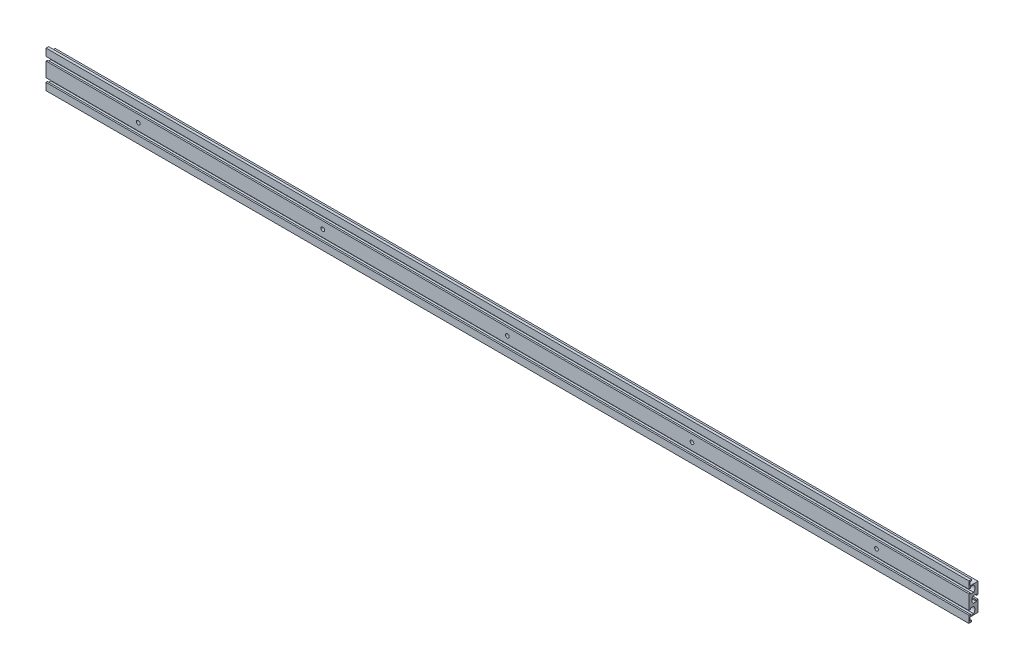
ISO-10303-21;
HEADER;
FILE_DESCRIPTION(('STEP AP214'),'2;1');
FILE_NAME('part.step','',(''),(''),'','','');
FILE_SCHEMA(('AUTOMOTIVE_DESIGN { 1 0 10303 214 1 1 1 1 }'));
ENDSEC;
DATA;
#1=APPLICATION_CONTEXT('core data for automotive mechanical design processes');
#2=APPLICATION_PROTOCOL_DEFINITION('international standard','automotive_design',2000,#1);
#3=PRODUCT_CONTEXT('',#1,'mechanical');
#4=PRODUCT('Part','Part','',(#3));
#5=PRODUCT_RELATED_PRODUCT_CATEGORY('part','',(#4));
#6=PRODUCT_DEFINITION_FORMATION('','',#4);
#7=PRODUCT_DEFINITION_CONTEXT('part definition',#1,'design');
#8=PRODUCT_DEFINITION('design','',#6,#7);
#9=PRODUCT_DEFINITION_SHAPE('','',#8);
#10=(LENGTH_UNIT() NAMED_UNIT(*) SI_UNIT(.MILLI.,.METRE.));
#11=(NAMED_UNIT(*) PLANE_ANGLE_UNIT() SI_UNIT($,.RADIAN.));
#12=(NAMED_UNIT(*) SI_UNIT($,.STERADIAN.) SOLID_ANGLE_UNIT());
#13=UNCERTAINTY_MEASURE_WITH_UNIT(LENGTH_MEASURE(1.E-05),#10,'distance_accuracy_value','');
#14=(GEOMETRIC_REPRESENTATION_CONTEXT(3) GLOBAL_UNCERTAINTY_ASSIGNED_CONTEXT((#13)) GLOBAL_UNIT_ASSIGNED_CONTEXT((#10,
#11,#12)) REPRESENTATION_CONTEXT('',''));
#15=CARTESIAN_POINT('',(0.,0.,0.));
#16=DIRECTION('',(0.,0.,1.));
#17=DIRECTION('',(1.,0.,0.));
#18=AXIS2_PLACEMENT_3D('',#15,#16,#17);
#19=CARTESIAN_POINT('',(0.,38.,5.25));
#20=DIRECTION('',(0.,0.,1.));
#21=DIRECTION('',(1.,0.,0.));
#22=AXIS2_PLACEMENT_3D('',#19,#20,#21);
#23=PLANE('',#22);
#24=DIRECTION('',(1.,0.,0.));
#25=VECTOR('',#24,1.);
#26=CARTESIAN_POINT('',(-3.20156211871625,27.5,5.25));
#27=LINE('',#26,#25);
#28=CARTESIAN_POINT('',(1500.,27.5,5.25));
#29=VERTEX_POINT('',#28);
#30=CARTESIAN_POINT('',(0.,27.5,5.25));
#31=VERTEX_POINT('',#30);
#32=EDGE_CURVE('E323',#29,#31,#27,.F.);
#33=ORIENTED_EDGE('',*,*,#32,.F.);
#34=DIRECTION('',(0.,1.,0.));
#35=VECTOR('',#34,1.);
#36=CARTESIAN_POINT('',(1500.,0.,5.25));
#37=LINE('',#36,#35);
#38=CARTESIAN_POINT('',(1500.,22.,5.25));
#39=VERTEX_POINT('',#38);
#40=EDGE_CURVE('E441',#39,#29,#37,.T.);
#41=ORIENTED_EDGE('',*,*,#40,.F.);
#42=DIRECTION('',(1.,0.,0.));
#43=VECTOR('',#42,1.);
#44=CARTESIAN_POINT('',(0.,22.,5.25));
#45=LINE('',#44,#43);
#46=CARTESIAN_POINT('',(0.,22.,5.25));
#47=VERTEX_POINT('',#46);
#48=EDGE_CURVE('E339',#39,#47,#45,.F.);
#49=ORIENTED_EDGE('',*,*,#48,.T.);
#50=DIRECTION('',(0.,1.,0.));
#51=VECTOR('',#50,1.);
#52=CARTESIAN_POINT('',(0.,0.,5.25));
#53=LINE('',#52,#51);
#54=EDGE_CURVE('E328',#47,#31,#53,.T.);
#55=ORIENTED_EDGE('',*,*,#54,.T.);
#56=EDGE_LOOP('',(#33,#41,#49,#55));
#57=FACE_BOUND('',#56,.T.);
#58=ADVANCED_FACE('F17',(#57),#23,.F.);
#59=CARTESIAN_POINT('',(-3.20156211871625,27.5,5.25));
#60=DIRECTION('',(0.,-1.,0.));
#61=DIRECTION('',(0.,0.,-1.));
#62=AXIS2_PLACEMENT_3D('',#59,#60,#61);
#63=PLANE('',#62);
#64=DIRECTION('',(0.,0.,-1.));
#65=VECTOR('',#64,1.);
#66=CARTESIAN_POINT('',(1500.,27.5,0.));
#67=LINE('',#66,#65);
#68=CARTESIAN_POINT('',(1500.,27.5,3.25));
#69=VERTEX_POINT('',#68);
#70=EDGE_CURVE('E437',#29,#69,#67,.T.);
#71=ORIENTED_EDGE('',*,*,#70,.F.);
#72=ORIENTED_EDGE('',*,*,#32,.T.);
#73=DIRECTION('',(0.,0.,-1.));
#74=VECTOR('',#73,1.);
#75=CARTESIAN_POINT('',(0.,27.5,0.));
#76=LINE('',#75,#74);
#77=CARTESIAN_POINT('',(0.,27.5,3.25));
#78=VERTEX_POINT('',#77);
#79=EDGE_CURVE('E319',#31,#78,#76,.T.);
#80=ORIENTED_EDGE('',*,*,#79,.T.);
#81=DIRECTION('',(1.,0.,0.));
#82=VECTOR('',#81,1.);
#83=CARTESIAN_POINT('',(-3.20156211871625,27.5,3.25));
#84=LINE('',#83,#82);
#85=EDGE_CURVE('E314',#69,#78,#84,.F.);
#86=ORIENTED_EDGE('',*,*,#85,.F.);
#87=EDGE_LOOP('',(#71,#72,#80,#86));
#88=FACE_BOUND('',#87,.T.);
#89=ADVANCED_FACE('F915',(#88),#63,.T.);
#90=CARTESIAN_POINT('',(-3.20156211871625,30.,3.25));
#91=DIRECTION('',(0.,0.,-1.));
#92=DIRECTION('',(0.,1.,0.));
#93=AXIS2_PLACEMENT_3D('',#90,#91,#92);
#94=PLANE('',#93);
#95=DIRECTION('',(0.,1.,0.));
#96=VECTOR('',#95,1.);
#97=CARTESIAN_POINT('',(1500.,0.,3.25));
#98=LINE('',#97,#96);
#99=CARTESIAN_POINT('',(1500.,30.,3.25));
#100=VERTEX_POINT('',#99);
#101=EDGE_CURVE('E433',#69,#100,#98,.T.);
#102=ORIENTED_EDGE('',*,*,#101,.F.);
#103=ORIENTED_EDGE('',*,*,#85,.T.);
#104=DIRECTION('',(0.,1.,0.));
#105=VECTOR('',#104,1.);
#106=CARTESIAN_POINT('',(0.,0.,3.25));
#107=LINE('',#106,#105);
#108=CARTESIAN_POINT('',(0.,30.,3.25));
#109=VERTEX_POINT('',#108);
#110=EDGE_CURVE('E309',#78,#109,#107,.T.);
#111=ORIENTED_EDGE('',*,*,#110,.T.);
#112=DIRECTION('',(1.,0.,0.));
#113=VECTOR('',#112,1.);
#114=CARTESIAN_POINT('',(1500.,30.,3.25));
#115=LINE('',#114,#113);
#116=EDGE_CURVE('E304',#109,#100,#115,.T.);
#117=ORIENTED_EDGE('',*,*,#116,.T.);
#118=EDGE_LOOP('',(#102,#103,#111,#117));
#119=FACE_BOUND('',#118,.T.);
#120=ADVANCED_FACE('F919',(#119),#94,.T.);
#121=CARTESIAN_POINT('',(1500.,30.,7.50000000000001));
#122=DIRECTION('',(0.,-1.,0.));
#123=DIRECTION('',(0.,0.,-1.));
#124=AXIS2_PLACEMENT_3D('',#121,#122,#123);
#125=PLANE('',#124);
#126=ORIENTED_EDGE('',*,*,#116,.F.);
#127=DIRECTION('',(0.,0.,-1.));
#128=VECTOR('',#127,1.);
#129=CARTESIAN_POINT('',(0.,30.,0.));
#130=LINE('',#129,#128);
#131=CARTESIAN_POINT('',(0.,30.,7.50000000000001));
#132=VERTEX_POINT('',#131);
#133=EDGE_CURVE('E299',#109,#132,#130,.F.);
#134=ORIENTED_EDGE('',*,*,#133,.T.);
#135=DIRECTION('',(1.,0.,0.));
#136=VECTOR('',#135,1.);
#137=CARTESIAN_POINT('',(1500.,30.,7.50000000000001));
#138=LINE('',#137,#136);
#139=CARTESIAN_POINT('',(1500.,30.,7.50000000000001));
#140=VERTEX_POINT('',#139);
#141=EDGE_CURVE('E294',#132,#140,#138,.T.);
#142=ORIENTED_EDGE('',*,*,#141,.T.);
#143=DIRECTION('',(0.,0.,-1.));
#144=VECTOR('',#143,1.);
#145=CARTESIAN_POINT('',(1500.,30.,0.));
#146=LINE('',#145,#144);
#147=EDGE_CURVE('E429',#100,#140,#146,.F.);
#148=ORIENTED_EDGE('',*,*,#147,.F.);
#149=EDGE_LOOP('',(#126,#134,#142,#148));
#150=FACE_BOUND('',#149,.T.);
#151=ADVANCED_FACE('F923',(#150),#125,.F.);
#152=CARTESIAN_POINT('',(1500.,30.,7.50000000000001));
#153=DIRECTION('',(0.,0.,-1.));
#154=DIRECTION('',(0.,1.,0.));
#155=AXIS2_PLACEMENT_3D('',#152,#153,#154);
#156=PLANE('',#155);
#157=DIRECTION('',(1.,0.,0.));
#158=VECTOR('',#157,1.);
#159=CARTESIAN_POINT('',(-3.20156211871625,18.25,7.50000000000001));
#160=LINE('',#159,#158);
#161=CARTESIAN_POINT('',(1500.,18.25,7.50000000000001));
#162=VERTEX_POINT('',#161);
#163=CARTESIAN_POINT('',(0.,18.25,7.50000000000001));
#164=VERTEX_POINT('',#163);
#165=EDGE_CURVE('E285',#162,#164,#160,.F.);
#166=ORIENTED_EDGE('',*,*,#165,.F.);
#167=DIRECTION('',(0.,1.,0.));
#168=VECTOR('',#167,1.);
#169=CARTESIAN_POINT('',(1500.,0.,7.50000000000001));
#170=LINE('',#169,#168);
#171=EDGE_CURVE('E425',#140,#162,#170,.F.);
#172=ORIENTED_EDGE('',*,*,#171,.F.);
#173=ORIENTED_EDGE('',*,*,#141,.F.);
#174=DIRECTION('',(0.,1.,0.));
#175=VECTOR('',#174,1.);
#176=CARTESIAN_POINT('',(0.,0.,7.50000000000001));
#177=LINE('',#176,#175);
#178=EDGE_CURVE('E290',#132,#164,#177,.F.);
#179=ORIENTED_EDGE('',*,*,#178,.T.);
#180=EDGE_LOOP('',(#166,#172,#173,#179));
#181=FACE_BOUND('',#180,.T.);
#182=ADVANCED_FACE('F928',(#181),#156,.F.);
#183=CARTESIAN_POINT('',(-3.20156211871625,18.25,7.50000000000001));
#184=DIRECTION('',(0.,-1.,0.));
#185=DIRECTION('',(0.,0.,-1.));
#186=AXIS2_PLACEMENT_3D('',#183,#184,#185);
#187=PLANE('',#186);
#188=DIRECTION('',(0.,0.,-1.));
#189=VECTOR('',#188,1.);
#190=CARTESIAN_POINT('',(1500.,18.25,0.));
#191=LINE('',#190,#189);
#192=CARTESIAN_POINT('',(1500.,18.25,5.00000000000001));
#193=VERTEX_POINT('',#192);
#194=EDGE_CURVE('E421',#162,#193,#191,.T.);
#195=ORIENTED_EDGE('',*,*,#194,.F.);
#196=ORIENTED_EDGE('',*,*,#165,.T.);
#197=DIRECTION('',(0.,0.,-1.));
#198=VECTOR('',#197,1.);
#199=CARTESIAN_POINT('',(0.,18.25,0.));
#200=LINE('',#199,#198);
#201=CARTESIAN_POINT('',(0.,18.25,5.00000000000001));
#202=VERTEX_POINT('',#201);
#203=EDGE_CURVE('E281',#164,#202,#200,.T.);
#204=ORIENTED_EDGE('',*,*,#203,.T.);
#205=DIRECTION('',(1.,0.,0.));
#206=VECTOR('',#205,1.);
#207=CARTESIAN_POINT('',(-3.20156211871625,18.25,5.00000000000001));
#208=LINE('',#207,#206);
#209=EDGE_CURVE('E270',#193,#202,#208,.F.);
#210=ORIENTED_EDGE('',*,*,#209,.F.);
#211=EDGE_LOOP('',(#195,#196,#204,#210));
#212=FACE_BOUND('',#211,.T.);
#213=ADVANCED_FACE('F932',(#212),#187,.T.);
#214=CARTESIAN_POINT('',(-3.20156211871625,20.25,5.00000000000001));
#215=DIRECTION('',(0.,0.,-1.));
#216=DIRECTION('',(0.,1.,0.));
#217=AXIS2_PLACEMENT_3D('',#214,#215,#216);
#218=PLANE('',#217);
#219=DIRECTION('',(0.,1.,0.));
#220=VECTOR('',#219,1.);
#221=CARTESIAN_POINT('',(1500.,0.,5.00000000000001));
#222=LINE('',#221,#220);
#223=CARTESIAN_POINT('',(1500.,20.25,5.00000000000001));
#224=VERTEX_POINT('',#223);
#225=EDGE_CURVE('E259',#193,#224,#222,.T.);
#226=ORIENTED_EDGE('',*,*,#225,.F.);
#227=ORIENTED_EDGE('',*,*,#209,.T.);
#228=DIRECTION('',(0.,1.,0.));
#229=VECTOR('',#228,1.);
#230=CARTESIAN_POINT('',(0.,0.,5.00000000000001));
#231=LINE('',#230,#229);
#232=CARTESIAN_POINT('',(0.,20.25,5.00000000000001));
#233=VERTEX_POINT('',#232);
#234=EDGE_CURVE('E278',#202,#233,#231,.T.);
#235=ORIENTED_EDGE('',*,*,#234,.T.);
#236=DIRECTION('',(1.,0.,0.));
#237=VECTOR('',#236,1.);
#238=CARTESIAN_POINT('',(0.,20.25,5.00000000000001));
#239=LINE('',#238,#237);
#240=EDGE_CURVE('E266',#233,#224,#239,.T.);
#241=ORIENTED_EDGE('',*,*,#240,.T.);
#242=EDGE_LOOP('',(#226,#227,#235,#241));
#243=FACE_BOUND('',#242,.T.);
#244=ADVANCED_FACE('F936',(#243),#218,.T.);
#245=CARTESIAN_POINT('',(0.,20.25,15.5));
#246=DIRECTION('',(0.,1.,0.));
#247=DIRECTION('',(0.,0.,1.));
#248=AXIS2_PLACEMENT_3D('',#245,#246,#247);
#249=PLANE('',#248);
#250=ORIENTED_EDGE('',*,*,#240,.F.);
#251=DIRECTION('',(0.,0.,-1.));
#252=VECTOR('',#251,1.);
#253=CARTESIAN_POINT('',(0.,20.25,0.));
#254=LINE('',#253,#252);
#255=CARTESIAN_POINT('',(0.,20.25,-0.5));
#256=VERTEX_POINT('',#255);
#257=EDGE_CURVE('E265',#233,#256,#254,.T.);
#258=ORIENTED_EDGE('',*,*,#257,.T.);
#259=DIRECTION('',(1.,0.,0.));
#260=VECTOR('',#259,1.);
#261=CARTESIAN_POINT('',(0.,20.25,-0.5));
#262=LINE('',#261,#260);
#263=CARTESIAN_POINT('',(1500.,20.25,-0.5));
#264=VERTEX_POINT('',#263);
#265=EDGE_CURVE('E248',#256,#264,#262,.T.);
#266=ORIENTED_EDGE('',*,*,#265,.T.);
#267=DIRECTION('',(0.,0.,-1.));
#268=VECTOR('',#267,1.);
#269=CARTESIAN_POINT('',(1500.,20.25,0.));
#270=LINE('',#269,#268);
#271=EDGE_CURVE('E253',#224,#264,#270,.T.);
#272=ORIENTED_EDGE('',*,*,#271,.F.);
#273=EDGE_LOOP('',(#250,#258,#266,#272));
#274=FACE_BOUND('',#273,.T.);
#275=ADVANCED_FACE('F263',(#274),#249,.F.);
#276=CARTESIAN_POINT('',(0.,15.,5.53634823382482));
#277=DIRECTION('',(1.,0.,0.));
#278=DIRECTION('',(0.,0.,-1.));
#279=AXIS2_PLACEMENT_3D('',#276,#277,#278);
#280=CYLINDRICAL_SURFACE('',#279,8.);
#281=CARTESIAN_POINT('',(0.,15.,5.53634823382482));
#282=DIRECTION('',(1.,0.,0.));
#283=DIRECTION('',(0.,0.,-1.));
#284=AXIS2_PLACEMENT_3D('',#281,#282,#283);
#285=CIRCLE('',#284,8.);
#286=CARTESIAN_POINT('',(0.,9.75,-0.500000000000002));
#287=VERTEX_POINT('',#286);
#288=EDGE_CURVE('E504',#256,#287,#285,.F.);
#289=ORIENTED_EDGE('',*,*,#288,.T.);
#290=DIRECTION('',(1.,0.,0.));
#291=VECTOR('',#290,1.);
#292=CARTESIAN_POINT('',(0.,9.75,-0.5));
#293=LINE('',#292,#291);
#294=CARTESIAN_POINT('',(1500.,9.75,-0.500000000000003));
#295=VERTEX_POINT('',#294);
#296=EDGE_CURVE('E250',#287,#295,#293,.T.);
#297=ORIENTED_EDGE('',*,*,#296,.T.);
#298=CARTESIAN_POINT('',(1500.,15.,5.53634823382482));
#299=DIRECTION('',(1.,0.,0.));
#300=DIRECTION('',(0.,0.,-1.));
#301=AXIS2_PLACEMENT_3D('',#298,#299,#300);
#302=CIRCLE('',#301,8.);
#303=EDGE_CURVE('E241',#264,#295,#302,.F.);
#304=ORIENTED_EDGE('',*,*,#303,.F.);
#305=ORIENTED_EDGE('',*,*,#265,.F.);
#306=EDGE_LOOP('',(#289,#297,#304,#305));
#307=FACE_BOUND('',#306,.T.);
#308=ADVANCED_FACE('F246',(#307),#280,.F.);
#309=CARTESIAN_POINT('',(0.,9.75,15.5));
#310=DIRECTION('',(0.,-1.,0.));
#311=DIRECTION('',(0.,0.,-1.));
#312=AXIS2_PLACEMENT_3D('',#309,#310,#311);
#313=PLANE('',#312);
#314=DIRECTION('',(1.,0.,0.));
#315=VECTOR('',#314,1.);
#316=CARTESIAN_POINT('',(-3.20156211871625,9.75,5.));
#317=LINE('',#316,#315);
#318=CARTESIAN_POINT('',(1500.,9.75,5.));
#319=VERTEX_POINT('',#318);
#320=CARTESIAN_POINT('',(0.,9.75,5.));
#321=VERTEX_POINT('',#320);
#322=EDGE_CURVE('E268',#319,#321,#317,.F.);
#323=ORIENTED_EDGE('',*,*,#322,.F.);
#324=DIRECTION('',(0.,0.,-1.));
#325=VECTOR('',#324,1.);
#326=CARTESIAN_POINT('',(1500.,9.75,0.));
#327=LINE('',#326,#325);
#328=EDGE_CURVE('E252',#295,#319,#327,.F.);
#329=ORIENTED_EDGE('',*,*,#328,.F.);
#330=ORIENTED_EDGE('',*,*,#296,.F.);
#331=DIRECTION('',(0.,0.,-1.));
#332=VECTOR('',#331,1.);
#333=CARTESIAN_POINT('',(0.,9.75,0.));
#334=LINE('',#333,#332);
#335=EDGE_CURVE('E506',#287,#321,#334,.F.);
#336=ORIENTED_EDGE('',*,*,#335,.T.);
#337=EDGE_LOOP('',(#323,#329,#330,#336));
#338=FACE_BOUND('',#337,.T.);
#339=ADVANCED_FACE('F777',(#338),#313,.F.);
#340=CARTESIAN_POINT('',(-3.20156211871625,9.75,5.));
#341=DIRECTION('',(0.,0.,-1.));
#342=DIRECTION('',(0.,1.,0.));
#343=AXIS2_PLACEMENT_3D('',#340,#341,#342);
#344=PLANE('',#343);
#345=DIRECTION('',(0.,1.,0.));
#346=VECTOR('',#345,1.);
#347=CARTESIAN_POINT('',(1500.,0.,5.));
#348=LINE('',#347,#346);
#349=CARTESIAN_POINT('',(1500.,11.75,5.00000000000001));
#350=VERTEX_POINT('',#349);
#351=EDGE_CURVE('E415',#319,#350,#348,.T.);
#352=ORIENTED_EDGE('',*,*,#351,.F.);
#353=ORIENTED_EDGE('',*,*,#322,.T.);
#354=DIRECTION('',(0.,1.,0.));
#355=VECTOR('',#354,1.);
#356=CARTESIAN_POINT('',(0.,0.,5.));
#357=LINE('',#356,#355);
#358=CARTESIAN_POINT('',(0.,11.75,5.00000000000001));
#359=VERTEX_POINT('',#358);
#360=EDGE_CURVE('E764',#321,#359,#357,.T.);
#361=ORIENTED_EDGE('',*,*,#360,.T.);
#362=DIRECTION('',(1.,0.,0.));
#363=VECTOR('',#362,1.);
#364=CARTESIAN_POINT('',(-3.20156211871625,11.75,5.00000000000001));
#365=LINE('',#364,#363);
#366=EDGE_CURVE('E458',#350,#359,#365,.F.);
#367=ORIENTED_EDGE('',*,*,#366,.F.);
#368=EDGE_LOOP('',(#352,#353,#361,#367));
#369=FACE_BOUND('',#368,.T.);
#370=ADVANCED_FACE('F772',(#369),#344,.T.);
#371=CARTESIAN_POINT('',(-3.20156211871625,-9.75,5.));
#372=DIRECTION('',(0.,0.,-1.));
#373=DIRECTION('',(0.,1.,0.));
#374=AXIS2_PLACEMENT_3D('',#371,#372,#373);
#375=PLANE('',#374);
#376=DIRECTION('',(0.,1.,0.));
#377=VECTOR('',#376,1.);
#378=CARTESIAN_POINT('',(1500.,0.,5.));
#379=LINE('',#378,#377);
#380=CARTESIAN_POINT('',(1500.,-11.75,5.));
#381=VERTEX_POINT('',#380);
#382=CARTESIAN_POINT('',(1500.,-9.75,5.));
#383=VERTEX_POINT('',#382);
#384=EDGE_CURVE('E353',#381,#383,#379,.T.);
#385=ORIENTED_EDGE('',*,*,#384,.F.);
#386=DIRECTION('',(1.,0.,0.));
#387=VECTOR('',#386,1.);
#388=CARTESIAN_POINT('',(-3.20156211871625,-11.75,5.));
#389=LINE('',#388,#387);
#390=CARTESIAN_POINT('',(0.,-11.75,5.));
#391=VERTEX_POINT('',#390);
#392=EDGE_CURVE('E360',#391,#381,#389,.T.);
#393=ORIENTED_EDGE('',*,*,#392,.F.);
#394=DIRECTION('',(0.,1.,0.));
#395=VECTOR('',#394,1.);
#396=CARTESIAN_POINT('',(0.,0.,5.));
#397=LINE('',#396,#395);
#398=CARTESIAN_POINT('',(0.,-9.75,5.));
#399=VERTEX_POINT('',#398);
#400=EDGE_CURVE('E745',#391,#399,#397,.T.);
#401=ORIENTED_EDGE('',*,*,#400,.T.);
#402=DIRECTION('',(1.,0.,0.));
#403=VECTOR('',#402,1.);
#404=CARTESIAN_POINT('',(0.,-9.75,5.));
#405=LINE('',#404,#403);
#406=EDGE_CURVE('E740',#399,#383,#405,.T.);
#407=ORIENTED_EDGE('',*,*,#406,.T.);
#408=EDGE_LOOP('',(#385,#393,#401,#407));
#409=FACE_BOUND('',#408,.T.);
#410=ADVANCED_FACE('F986',(#409),#375,.T.);
#411=CARTESIAN_POINT('',(0.,-9.75,15.5));
#412=DIRECTION('',(0.,1.,0.));
#413=DIRECTION('',(0.,0.,1.));
#414=AXIS2_PLACEMENT_3D('',#411,#412,#413);
#415=PLANE('',#414);
#416=ORIENTED_EDGE('',*,*,#406,.F.);
#417=DIRECTION('',(0.,0.,-1.));
#418=VECTOR('',#417,1.);
#419=CARTESIAN_POINT('',(0.,-9.75,0.));
#420=LINE('',#419,#418);
#421=CARTESIAN_POINT('',(0.,-9.75,-0.499999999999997));
#422=VERTEX_POINT('',#421);
#423=EDGE_CURVE('E503',#399,#422,#420,.T.);
#424=ORIENTED_EDGE('',*,*,#423,.T.);
#425=DIRECTION('',(1.,0.,0.));
#426=VECTOR('',#425,1.);
#427=CARTESIAN_POINT('',(0.,-9.75,-0.499999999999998));
#428=LINE('',#427,#426);
#429=CARTESIAN_POINT('',(1500.,-9.75,-0.499999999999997));
#430=VERTEX_POINT('',#429);
#431=EDGE_CURVE('E737',#422,#430,#428,.T.);
#432=ORIENTED_EDGE('',*,*,#431,.T.);
#433=DIRECTION('',(0.,0.,-1.));
#434=VECTOR('',#433,1.);
#435=CARTESIAN_POINT('',(1500.,-9.75,0.));
#436=LINE('',#435,#434);
#437=EDGE_CURVE('E355',#383,#430,#436,.T.);
#438=ORIENTED_EDGE('',*,*,#437,.F.);
#439=EDGE_LOOP('',(#416,#424,#432,#438));
#440=FACE_BOUND('',#439,.T.);
#441=ADVANCED_FACE('F802',(#440),#415,.F.);
#442=CARTESIAN_POINT('',(0.,-15.,5.53634823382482));
#443=DIRECTION('',(1.,0.,0.));
#444=DIRECTION('',(0.,0.,-1.));
#445=AXIS2_PLACEMENT_3D('',#442,#443,#444);
#446=CYLINDRICAL_SURFACE('',#445,8.);
#447=CARTESIAN_POINT('',(0.,-15.,5.53634823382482));
#448=DIRECTION('',(1.,0.,0.));
#449=DIRECTION('',(0.,0.,-1.));
#450=AXIS2_PLACEMENT_3D('',#447,#448,#449);
#451=CIRCLE('',#450,8.);
#452=CARTESIAN_POINT('',(0.,-20.25,-0.499999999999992));
#453=VERTEX_POINT('',#452);
#454=EDGE_CURVE('E499',#422,#453,#451,.F.);
#455=ORIENTED_EDGE('',*,*,#454,.T.);
#456=DIRECTION('',(1.,0.,0.));
#457=VECTOR('',#456,1.);
#458=CARTESIAN_POINT('',(0.,-20.25,-0.499999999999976));
#459=LINE('',#458,#457);
#460=CARTESIAN_POINT('',(1500.,-20.25,-0.499999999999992));
#461=VERTEX_POINT('',#460);
#462=EDGE_CURVE('E732',#453,#461,#459,.T.);
#463=ORIENTED_EDGE('',*,*,#462,.T.);
#464=CARTESIAN_POINT('',(1500.,-15.,5.53634823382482));
#465=DIRECTION('',(1.,0.,0.));
#466=DIRECTION('',(0.,0.,-1.));
#467=AXIS2_PLACEMENT_3D('',#464,#465,#466);
#468=CIRCLE('',#467,8.);
#469=EDGE_CURVE('E509',#430,#461,#468,.F.);
#470=ORIENTED_EDGE('',*,*,#469,.F.);
#471=ORIENTED_EDGE('',*,*,#431,.F.);
#472=EDGE_LOOP('',(#455,#463,#470,#471));
#473=FACE_BOUND('',#472,.T.);
#474=ADVANCED_FACE('F805',(#473),#446,.F.);
#475=CARTESIAN_POINT('',(0.,-20.25,15.5));
#476=DIRECTION('',(0.,-1.,0.));
#477=DIRECTION('',(0.,0.,-1.));
#478=AXIS2_PLACEMENT_3D('',#475,#476,#477);
#479=PLANE('',#478);
#480=DIRECTION('',(1.,0.,0.));
#481=VECTOR('',#480,1.);
#482=CARTESIAN_POINT('',(-3.20156211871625,-20.25,5.));
#483=LINE('',#482,#481);
#484=CARTESIAN_POINT('',(1500.,-20.25,5.));
#485=VERTEX_POINT('',#484);
#486=CARTESIAN_POINT('',(0.,-20.25,5.));
#487=VERTEX_POINT('',#486);
#488=EDGE_CURVE('E724',#485,#487,#483,.F.);
#489=ORIENTED_EDGE('',*,*,#488,.F.);
#490=DIRECTION('',(0.,0.,-1.));
#491=VECTOR('',#490,1.);
#492=CARTESIAN_POINT('',(1500.,-20.25,0.));
#493=LINE('',#492,#491);
#494=EDGE_CURVE('E412',#461,#485,#493,.F.);
#495=ORIENTED_EDGE('',*,*,#494,.F.);
#496=ORIENTED_EDGE('',*,*,#462,.F.);
#497=DIRECTION('',(0.,0.,-1.));
#498=VECTOR('',#497,1.);
#499=CARTESIAN_POINT('',(0.,-20.25,0.));
#500=LINE('',#499,#498);
#501=EDGE_CURVE('E502',#453,#487,#500,.F.);
#502=ORIENTED_EDGE('',*,*,#501,.T.);
#503=EDGE_LOOP('',(#489,#495,#496,#502));
#504=FACE_BOUND('',#503,.T.);
#505=ADVANCED_FACE('F811',(#504),#479,.F.);
#506=CARTESIAN_POINT('',(-3.20156211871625,-20.25,5.));
#507=DIRECTION('',(0.,0.,-1.));
#508=DIRECTION('',(0.,1.,0.));
#509=AXIS2_PLACEMENT_3D('',#506,#507,#508);
#510=PLANE('',#509);
#511=DIRECTION('',(0.,1.,0.));
#512=VECTOR('',#511,1.);
#513=CARTESIAN_POINT('',(1500.,0.,5.));
#514=LINE('',#513,#512);
#515=CARTESIAN_POINT('',(1500.,-18.25,5.));
#516=VERTEX_POINT('',#515);
#517=EDGE_CURVE('E408',#485,#516,#514,.T.);
#518=ORIENTED_EDGE('',*,*,#517,.F.);
#519=ORIENTED_EDGE('',*,*,#488,.T.);
#520=DIRECTION('',(0.,1.,0.));
#521=VECTOR('',#520,1.);
#522=CARTESIAN_POINT('',(0.,0.,5.));
#523=LINE('',#522,#521);
#524=CARTESIAN_POINT('',(0.,-18.25,5.));
#525=VERTEX_POINT('',#524);
#526=EDGE_CURVE('E720',#487,#525,#523,.T.);
#527=ORIENTED_EDGE('',*,*,#526,.T.);
#528=DIRECTION('',(1.,0.,0.));
#529=VECTOR('',#528,1.);
#530=CARTESIAN_POINT('',(-3.20156211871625,-18.25,5.));
#531=LINE('',#530,#529);
#532=EDGE_CURVE('E715',#516,#525,#531,.F.);
#533=ORIENTED_EDGE('',*,*,#532,.F.);
#534=EDGE_LOOP('',(#518,#519,#527,#533));
#535=FACE_BOUND('',#534,.T.);
#536=ADVANCED_FACE('F816',(#535),#510,.T.);
#537=CARTESIAN_POINT('',(-3.20156211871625,-18.25,7.5));
#538=DIRECTION('',(0.,1.,0.));
#539=DIRECTION('',(0.,0.,1.));
#540=AXIS2_PLACEMENT_3D('',#537,#538,#539);
#541=PLANE('',#540);
#542=DIRECTION('',(0.,0.,-1.));
#543=VECTOR('',#542,1.);
#544=CARTESIAN_POINT('',(1500.,-18.25,0.));
#545=LINE('',#544,#543);
#546=CARTESIAN_POINT('',(1500.,-18.25,7.5));
#547=VERTEX_POINT('',#546);
#548=EDGE_CURVE('E404',#516,#547,#545,.F.);
#549=ORIENTED_EDGE('',*,*,#548,.F.);
#550=ORIENTED_EDGE('',*,*,#532,.T.);
#551=DIRECTION('',(0.,0.,-1.));
#552=VECTOR('',#551,1.);
#553=CARTESIAN_POINT('',(0.,-18.25,0.));
#554=LINE('',#553,#552);
#555=CARTESIAN_POINT('',(0.,-18.25,7.5));
#556=VERTEX_POINT('',#555);
#557=EDGE_CURVE('E710',#525,#556,#554,.F.);
#558=ORIENTED_EDGE('',*,*,#557,.T.);
#559=DIRECTION('',(1.,0.,0.));
#560=VECTOR('',#559,1.);
#561=CARTESIAN_POINT('',(1500.,-18.25,7.5));
#562=LINE('',#561,#560);
#563=EDGE_CURVE('E705',#556,#547,#562,.T.);
#564=ORIENTED_EDGE('',*,*,#563,.T.);
#565=EDGE_LOOP('',(#549,#550,#558,#564));
#566=FACE_BOUND('',#565,.T.);
#567=ADVANCED_FACE('F820',(#566),#541,.T.);
#568=CARTESIAN_POINT('',(1500.,30.,7.50000000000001));
#569=DIRECTION('',(0.,0.,-1.));
#570=DIRECTION('',(0.,1.,0.));
#571=AXIS2_PLACEMENT_3D('',#568,#569,#570);
#572=PLANE('',#571);
#573=ORIENTED_EDGE('',*,*,#563,.F.);
#574=DIRECTION('',(0.,1.,0.));
#575=VECTOR('',#574,1.);
#576=CARTESIAN_POINT('',(0.,0.,7.5));
#577=LINE('',#576,#575);
#578=CARTESIAN_POINT('',(0.,-30.,7.5));
#579=VERTEX_POINT('',#578);
#580=EDGE_CURVE('E700',#556,#579,#577,.F.);
#581=ORIENTED_EDGE('',*,*,#580,.T.);
#582=DIRECTION('',(1.,0.,0.));
#583=VECTOR('',#582,1.);
#584=CARTESIAN_POINT('',(1500.,-30.,7.5));
#585=LINE('',#584,#583);
#586=CARTESIAN_POINT('',(1500.,-30.,7.5));
#587=VERTEX_POINT('',#586);
#588=EDGE_CURVE('E695',#579,#587,#585,.T.);
#589=ORIENTED_EDGE('',*,*,#588,.T.);
#590=DIRECTION('',(0.,1.,0.));
#591=VECTOR('',#590,1.);
#592=CARTESIAN_POINT('',(1500.,0.,7.5));
#593=LINE('',#592,#591);
#594=EDGE_CURVE('E400',#547,#587,#593,.F.);
#595=ORIENTED_EDGE('',*,*,#594,.F.);
#596=EDGE_LOOP('',(#573,#581,#589,#595));
#597=FACE_BOUND('',#596,.T.);
#598=ADVANCED_FACE('F824',(#597),#572,.F.);
#599=CARTESIAN_POINT('',(1500.,-30.,7.5));
#600=DIRECTION('',(0.,1.,0.));
#601=DIRECTION('',(0.,0.,1.));
#602=AXIS2_PLACEMENT_3D('',#599,#600,#601);
#603=PLANE('',#602);
#604=DIRECTION('',(1.,0.,0.));
#605=VECTOR('',#604,1.);
#606=CARTESIAN_POINT('',(-3.20156211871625,-30.,3.25));
#607=LINE('',#606,#605);
#608=CARTESIAN_POINT('',(1500.,-30.,3.25));
#609=VERTEX_POINT('',#608);
#610=CARTESIAN_POINT('',(0.,-30.,3.25));
#611=VERTEX_POINT('',#610);
#612=EDGE_CURVE('E686',#609,#611,#607,.F.);
#613=ORIENTED_EDGE('',*,*,#612,.F.);
#614=DIRECTION('',(0.,0.,-1.));
#615=VECTOR('',#614,1.);
#616=CARTESIAN_POINT('',(1500.,-30.,0.));
#617=LINE('',#616,#615);
#618=EDGE_CURVE('E396',#587,#609,#617,.T.);
#619=ORIENTED_EDGE('',*,*,#618,.F.);
#620=ORIENTED_EDGE('',*,*,#588,.F.);
#621=DIRECTION('',(0.,0.,-1.));
#622=VECTOR('',#621,1.);
#623=CARTESIAN_POINT('',(0.,-30.,0.));
#624=LINE('',#623,#622);
#625=EDGE_CURVE('E691',#579,#611,#624,.T.);
#626=ORIENTED_EDGE('',*,*,#625,.T.);
#627=EDGE_LOOP('',(#613,#619,#620,#626));
#628=FACE_BOUND('',#627,.T.);
#629=ADVANCED_FACE('F830',(#628),#603,.F.);
#630=CARTESIAN_POINT('',(-3.20156211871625,-30.,3.25));
#631=DIRECTION('',(0.,0.,-1.));
#632=DIRECTION('',(0.,1.,0.));
#633=AXIS2_PLACEMENT_3D('',#630,#631,#632);
#634=PLANE('',#633);
#635=DIRECTION('',(0.,1.,0.));
#636=VECTOR('',#635,1.);
#637=CARTESIAN_POINT('',(1500.,0.,3.25));
#638=LINE('',#637,#636);
#639=CARTESIAN_POINT('',(1500.,-27.5,3.25));
#640=VERTEX_POINT('',#639);
#641=EDGE_CURVE('E392',#609,#640,#638,.T.);
#642=ORIENTED_EDGE('',*,*,#641,.F.);
#643=ORIENTED_EDGE('',*,*,#612,.T.);
#644=DIRECTION('',(0.,1.,0.));
#645=VECTOR('',#644,1.);
#646=CARTESIAN_POINT('',(0.,0.,3.25));
#647=LINE('',#646,#645);
#648=CARTESIAN_POINT('',(0.,-27.5,3.25));
#649=VERTEX_POINT('',#648);
#650=EDGE_CURVE('E682',#611,#649,#647,.T.);
#651=ORIENTED_EDGE('',*,*,#650,.T.);
#652=DIRECTION('',(1.,0.,0.));
#653=VECTOR('',#652,1.);
#654=CARTESIAN_POINT('',(-3.20156211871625,-27.5,3.25));
#655=LINE('',#654,#653);
#656=EDGE_CURVE('E677',#640,#649,#655,.F.);
#657=ORIENTED_EDGE('',*,*,#656,.F.);
#658=EDGE_LOOP('',(#642,#643,#651,#657));
#659=FACE_BOUND('',#658,.T.);
#660=ADVANCED_FACE('F834',(#659),#634,.T.);
#661=CARTESIAN_POINT('',(-3.20156211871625,-27.5,5.25));
#662=DIRECTION('',(0.,1.,0.));
#663=DIRECTION('',(0.,0.,1.));
#664=AXIS2_PLACEMENT_3D('',#661,#662,#663);
#665=PLANE('',#664);
#666=DIRECTION('',(0.,0.,-1.));
#667=VECTOR('',#666,1.);
#668=CARTESIAN_POINT('',(1500.,-27.5,0.));
#669=LINE('',#668,#667);
#670=CARTESIAN_POINT('',(1500.,-27.5,5.25));
#671=VERTEX_POINT('',#670);
#672=EDGE_CURVE('E388',#640,#671,#669,.F.);
#673=ORIENTED_EDGE('',*,*,#672,.F.);
#674=ORIENTED_EDGE('',*,*,#656,.T.);
#675=DIRECTION('',(0.,0.,-1.));
#676=VECTOR('',#675,1.);
#677=CARTESIAN_POINT('',(0.,-27.5,0.));
#678=LINE('',#677,#676);
#679=CARTESIAN_POINT('',(0.,-27.5,5.25));
#680=VERTEX_POINT('',#679);
#681=EDGE_CURVE('E672',#649,#680,#678,.F.);
#682=ORIENTED_EDGE('',*,*,#681,.T.);
#683=DIRECTION('',(1.,0.,0.));
#684=VECTOR('',#683,1.);
#685=CARTESIAN_POINT('',(0.,-27.5,5.25));
#686=LINE('',#685,#684);
#687=EDGE_CURVE('E667',#680,#671,#686,.T.);
#688=ORIENTED_EDGE('',*,*,#687,.T.);
#689=EDGE_LOOP('',(#673,#674,#682,#688));
#690=FACE_BOUND('',#689,.T.);
#691=ADVANCED_FACE('F838',(#690),#665,.T.);
#692=CARTESIAN_POINT('',(0.,-38.,5.25));
#693=DIRECTION('',(0.,0.,1.));
#694=DIRECTION('',(0.,-1.,0.));
#695=AXIS2_PLACEMENT_3D('',#692,#693,#694);
#696=PLANE('',#695);
#697=ORIENTED_EDGE('',*,*,#687,.F.);
#698=DIRECTION('',(0.,1.,0.));
#699=VECTOR('',#698,1.);
#700=CARTESIAN_POINT('',(0.,0.,5.25));
#701=LINE('',#700,#699);
#702=CARTESIAN_POINT('',(0.,-22.,5.25));
#703=VERTEX_POINT('',#702);
#704=EDGE_CURVE('E662',#680,#703,#701,.T.);
#705=ORIENTED_EDGE('',*,*,#704,.T.);
#706=DIRECTION('',(1.,0.,0.));
#707=VECTOR('',#706,1.);
#708=CARTESIAN_POINT('',(0.,-22.,5.25));
#709=LINE('',#708,#707);
#710=CARTESIAN_POINT('',(1500.,-22.,5.25));
#711=VERTEX_POINT('',#710);
#712=EDGE_CURVE('E657',#703,#711,#709,.T.);
#713=ORIENTED_EDGE('',*,*,#712,.T.);
#714=DIRECTION('',(0.,1.,0.));
#715=VECTOR('',#714,1.);
#716=CARTESIAN_POINT('',(1500.,0.,5.25));
#717=LINE('',#716,#715);
#718=EDGE_CURVE('E384',#671,#711,#717,.T.);
#719=ORIENTED_EDGE('',*,*,#718,.F.);
#720=EDGE_LOOP('',(#697,#705,#713,#719));
#721=FACE_BOUND('',#720,.T.);
#722=ADVANCED_FACE('F842',(#721),#696,.F.);
#723=CARTESIAN_POINT('',(0.,-22.,5.25));
#724=DIRECTION('',(0.,1.,0.));
#725=DIRECTION('',(0.,0.,1.));
#726=AXIS2_PLACEMENT_3D('',#723,#724,#725);
#727=PLANE('',#726);
#728=DIRECTION('',(0.,0.,-1.));
#729=VECTOR('',#728,1.);
#730=CARTESIAN_POINT('',(0.,-22.,0.));
#731=LINE('',#730,#729);
#732=CARTESIAN_POINT('',(0.,-22.,-7.5));
#733=VERTEX_POINT('',#732);
#734=EDGE_CURVE('E652',#703,#733,#731,.T.);
#735=ORIENTED_EDGE('',*,*,#734,.T.);
#736=DIRECTION('',(1.,0.,0.));
#737=VECTOR('',#736,1.);
#738=CARTESIAN_POINT('',(1500.,-22.,-7.5));
#739=LINE('',#738,#737);
#740=CARTESIAN_POINT('',(1500.,-22.,-7.5));
#741=VERTEX_POINT('',#740);
#742=EDGE_CURVE('E647',#733,#741,#739,.T.);
#743=ORIENTED_EDGE('',*,*,#742,.T.);
#744=DIRECTION('',(0.,0.,-1.));
#745=VECTOR('',#744,1.);
#746=CARTESIAN_POINT('',(1500.,-22.,0.));
#747=LINE('',#746,#745);
#748=EDGE_CURVE('E380',#711,#741,#747,.T.);
#749=ORIENTED_EDGE('',*,*,#748,.F.);
#750=ORIENTED_EDGE('',*,*,#712,.F.);
#751=EDGE_LOOP('',(#735,#743,#749,#750));
#752=FACE_BOUND('',#751,.T.);
#753=ADVANCED_FACE('F846',(#752),#727,.F.);
#754=CARTESIAN_POINT('',(1500.,30.,-7.49999999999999));
#755=DIRECTION('',(0.,0.,1.));
#756=DIRECTION('',(0.,-1.,0.));
#757=AXIS2_PLACEMENT_3D('',#754,#755,#756);
#758=PLANE('',#757);
#759=ORIENTED_EDGE('',*,*,#742,.F.);
#760=DIRECTION('',(0.,1.,0.));
#761=VECTOR('',#760,1.);
#762=CARTESIAN_POINT('',(0.,0.,-7.5));
#763=LINE('',#762,#761);
#764=CARTESIAN_POINT('',(0.,-3.25,-7.5));
#765=VERTEX_POINT('',#764);
#766=EDGE_CURVE('E643',#733,#765,#763,.T.);
#767=ORIENTED_EDGE('',*,*,#766,.T.);
#768=DIRECTION('',(1.,0.,0.));
#769=VECTOR('',#768,1.);
#770=CARTESIAN_POINT('',(-3.20156211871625,-3.25,-7.5));
#771=LINE('',#770,#769);
#772=CARTESIAN_POINT('',(1500.,-3.25,-7.5));
#773=VERTEX_POINT('',#772);
#774=EDGE_CURVE('E638',#773,#765,#771,.F.);
#775=ORIENTED_EDGE('',*,*,#774,.F.);
#776=DIRECTION('',(0.,1.,0.));
#777=VECTOR('',#776,1.);
#778=CARTESIAN_POINT('',(1500.,0.,-7.5));
#779=LINE('',#778,#777);
#780=EDGE_CURVE('E376',#741,#773,#779,.T.);
#781=ORIENTED_EDGE('',*,*,#780,.F.);
#782=EDGE_LOOP('',(#759,#767,#775,#781));
#783=FACE_BOUND('',#782,.T.);
#784=ADVANCED_FACE('F851',(#783),#758,.F.);
#785=CARTESIAN_POINT('',(-3.20156211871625,-3.25,-7.5));
#786=DIRECTION('',(0.,1.,0.));
#787=DIRECTION('',(0.,0.,1.));
#788=AXIS2_PLACEMENT_3D('',#785,#786,#787);
#789=PLANE('',#788);
#790=DIRECTION('',(0.,0.,-1.));
#791=VECTOR('',#790,1.);
#792=CARTESIAN_POINT('',(1500.,-3.25,0.));
#793=LINE('',#792,#791);
#794=CARTESIAN_POINT('',(1500.,-3.25,-5.));
#795=VERTEX_POINT('',#794);
#796=EDGE_CURVE('E372',#773,#795,#793,.F.);
#797=ORIENTED_EDGE('',*,*,#796,.F.);
#798=ORIENTED_EDGE('',*,*,#774,.T.);
#799=DIRECTION('',(0.,0.,-1.));
#800=VECTOR('',#799,1.);
#801=CARTESIAN_POINT('',(0.,-3.25,0.));
#802=LINE('',#801,#800);
#803=CARTESIAN_POINT('',(0.,-3.25,-5.));
#804=VERTEX_POINT('',#803);
#805=EDGE_CURVE('E634',#765,#804,#802,.F.);
#806=ORIENTED_EDGE('',*,*,#805,.T.);
#807=DIRECTION('',(1.,0.,0.));
#808=VECTOR('',#807,1.);
#809=CARTESIAN_POINT('',(-3.20156211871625,-3.25,-5.));
#810=LINE('',#809,#808);
#811=EDGE_CURVE('E628',#795,#804,#810,.F.);
#812=ORIENTED_EDGE('',*,*,#811,.F.);
#813=EDGE_LOOP('',(#797,#798,#806,#812));
#814=FACE_BOUND('',#813,.T.);
#815=ADVANCED_FACE('F856',(#814),#789,.T.);
#816=CARTESIAN_POINT('',(-3.20156211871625,-5.25,-5.));
#817=DIRECTION('',(0.,0.,1.));
#818=DIRECTION('',(0.,-1.,0.));
#819=AXIS2_PLACEMENT_3D('',#816,#817,#818);
#820=PLANE('',#819);
#821=DIRECTION('',(0.,1.,0.));
#822=VECTOR('',#821,1.);
#823=CARTESIAN_POINT('',(1500.,0.,-5.));
#824=LINE('',#823,#822);
#825=CARTESIAN_POINT('',(1500.,-5.25,-5.));
#826=VERTEX_POINT('',#825);
#827=EDGE_CURVE('E369',#795,#826,#824,.F.);
#828=ORIENTED_EDGE('',*,*,#827,.F.);
#829=ORIENTED_EDGE('',*,*,#811,.T.);
#830=DIRECTION('',(0.,1.,0.));
#831=VECTOR('',#830,1.);
#832=CARTESIAN_POINT('',(0.,0.,-5.));
#833=LINE('',#832,#831);
#834=CARTESIAN_POINT('',(0.,-5.25,-5.));
#835=VERTEX_POINT('',#834);
#836=EDGE_CURVE('E631',#804,#835,#833,.F.);
#837=ORIENTED_EDGE('',*,*,#836,.T.);
#838=DIRECTION('',(1.,0.,0.));
#839=VECTOR('',#838,1.);
#840=CARTESIAN_POINT('',(0.,-5.25,-5.));
#841=LINE('',#840,#839);
#842=EDGE_CURVE('E625',#835,#826,#841,.T.);
#843=ORIENTED_EDGE('',*,*,#842,.T.);
#844=EDGE_LOOP('',(#828,#829,#837,#843));
#845=FACE_BOUND('',#844,.T.);
#846=ADVANCED_FACE('F860',(#845),#820,.T.);
#847=CARTESIAN_POINT('',(0.,-5.25,0.499999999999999));
#848=DIRECTION('',(0.,-1.,0.));
#849=DIRECTION('',(0.,0.,-1.));
#850=AXIS2_PLACEMENT_3D('',#847,#848,#849);
#851=PLANE('',#850);
#852=ORIENTED_EDGE('',*,*,#842,.F.);
#853=DIRECTION('',(0.,0.,-1.));
#854=VECTOR('',#853,1.);
#855=CARTESIAN_POINT('',(0.,-5.25,0.));
#856=LINE('',#855,#854);
#857=CARTESIAN_POINT('',(0.,-5.25,0.500000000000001));
#858=VERTEX_POINT('',#857);
#859=EDGE_CURVE('E498',#835,#858,#856,.F.);
#860=ORIENTED_EDGE('',*,*,#859,.T.);
#861=DIRECTION('',(1.,0.,0.));
#862=VECTOR('',#861,1.);
#863=CARTESIAN_POINT('',(0.,-5.25,0.500000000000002));
#864=LINE('',#863,#862);
#865=CARTESIAN_POINT('',(1500.,-5.25,0.500000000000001));
#866=VERTEX_POINT('',#865);
#867=EDGE_CURVE('E615',#858,#866,#864,.T.);
#868=ORIENTED_EDGE('',*,*,#867,.T.);
#869=DIRECTION('',(0.,0.,-1.));
#870=VECTOR('',#869,1.);
#871=CARTESIAN_POINT('',(1500.,-5.25,0.));
#872=LINE('',#871,#870);
#873=EDGE_CURVE('E371',#826,#866,#872,.F.);
#874=ORIENTED_EDGE('',*,*,#873,.F.);
#875=EDGE_LOOP('',(#852,#860,#868,#874));
#876=FACE_BOUND('',#875,.T.);
#877=ADVANCED_FACE('F865',(#876),#851,.F.);
#878=CARTESIAN_POINT('',(0.,0.,-5.53634823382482));
#879=DIRECTION('',(1.,0.,0.));
#880=DIRECTION('',(0.,0.,-1.));
#881=AXIS2_PLACEMENT_3D('',#878,#879,#880);
#882=CYLINDRICAL_SURFACE('',#881,8.);
#883=ORIENTED_EDGE('',*,*,#867,.F.);
#884=CARTESIAN_POINT('',(0.,0.,-5.53634823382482));
#885=DIRECTION('',(1.,0.,0.));
#886=DIRECTION('',(0.,0.,-1.));
#887=AXIS2_PLACEMENT_3D('',#884,#885,#886);
#888=CIRCLE('',#887,8.);
#889=CARTESIAN_POINT('',(0.,5.25,0.499999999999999));
#890=VERTEX_POINT('',#889);
#891=EDGE_CURVE('E494',#858,#890,#888,.F.);
#892=ORIENTED_EDGE('',*,*,#891,.T.);
#893=DIRECTION('',(1.,0.,0.));
#894=VECTOR('',#893,1.);
#895=CARTESIAN_POINT('',(0.,5.25,0.499999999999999));
#896=LINE('',#895,#894);
#897=CARTESIAN_POINT('',(1500.,5.25,0.499999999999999));
#898=VERTEX_POINT('',#897);
#899=EDGE_CURVE('E612',#890,#898,#896,.T.);
#900=ORIENTED_EDGE('',*,*,#899,.T.);
#901=CARTESIAN_POINT('',(1500.,0.,-5.53634823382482));
#902=DIRECTION('',(1.,0.,0.));
#903=DIRECTION('',(0.,0.,-1.));
#904=AXIS2_PLACEMENT_3D('',#901,#902,#903);
#905=CIRCLE('',#904,8.);
#906=EDGE_CURVE('E507',#866,#898,#905,.F.);
#907=ORIENTED_EDGE('',*,*,#906,.F.);
#908=EDGE_LOOP('',(#883,#892,#900,#907));
#909=FACE_BOUND('',#908,.T.);
#910=CARTESIAN_POINT('',(753.,0.,2.46365176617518));
#911=CARTESIAN_POINT('',(752.999988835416,0.162218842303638,2.46364355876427));
#912=CARTESIAN_POINT('',(752.986778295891,0.324597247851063,2.45866449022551));
#913=CARTESIAN_POINT('',(752.934413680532,0.644673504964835,2.43925313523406));
#914=CARTESIAN_POINT('',(752.895219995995,0.802363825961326,2.42480641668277));
#915=CARTESIAN_POINT('',(752.79248449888,1.10813814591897,2.38802456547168));
#916=CARTESIAN_POINT('',(752.729006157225,1.25624601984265,2.36571000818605));
#917=CARTESIAN_POINT('',(752.579759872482,1.53964440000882,2.31541835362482));
#918=CARTESIAN_POINT('',(752.493993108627,1.6749355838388,2.28744155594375));
#919=CARTESIAN_POINT('',(752.298777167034,1.93468912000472,2.22737735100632));
#920=CARTESIAN_POINT('',(752.188544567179,2.05853554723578,2.19517329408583));
#921=CARTESIAN_POINT('',(751.949185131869,2.28648377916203,2.13085768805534));
#922=CARTESIAN_POINT('',(751.820051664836,2.39057862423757,2.09874617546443));
#923=CARTESIAN_POINT('',(751.540564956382,2.57996406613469,2.03690115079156));
#924=CARTESIAN_POINT('',(751.38959105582,2.66438796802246,2.00730470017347));
#925=CARTESIAN_POINT('',(751.074303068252,2.80637301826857,1.95564894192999));
#926=CARTESIAN_POINT('',(750.90999435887,2.86394493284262,1.93358661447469));
#927=CARTESIAN_POINT('',(750.579766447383,2.94816863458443,1.90074001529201));
#928=CARTESIAN_POINT('',(750.414189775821,2.97599188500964,1.88953024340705));
#929=CARTESIAN_POINT('',(750.080367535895,3.00359113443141,1.87841299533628));
#930=CARTESIAN_POINT('',(749.912123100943,3.00337874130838,1.8785008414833));
#931=CARTESIAN_POINT('',(749.588461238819,2.97580860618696,1.88960198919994));
#932=CARTESIAN_POINT('',(749.432878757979,2.95007622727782,1.89996110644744));
#933=CARTESIAN_POINT('',(749.128426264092,2.87488358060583,1.92935045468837));
#934=CARTESIAN_POINT('',(748.97955729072,2.82541965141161,1.94838202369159));
#935=CARTESIAN_POINT('',(748.68944246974,2.70327340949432,1.99336633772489));
#936=CARTESIAN_POINT('',(748.548394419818,2.63016906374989,2.01944334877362));
#937=CARTESIAN_POINT('',(748.280102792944,2.46311770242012,2.07553732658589));
#938=CARTESIAN_POINT('',(748.152863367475,2.36916444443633,2.10555547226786));
#939=CARTESIAN_POINT('',(747.906811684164,2.15565035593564,2.16860763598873));
#940=CARTESIAN_POINT('',(747.789136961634,2.03479468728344,2.20170889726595));
#941=CARTESIAN_POINT('',(747.57535564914,1.77467657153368,2.26547651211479));
#942=CARTESIAN_POINT('',(747.479259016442,1.63540567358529,2.29614173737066));
#943=CARTESIAN_POINT('',(747.310063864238,1.33929583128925,2.35220353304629));
#944=CARTESIAN_POINT('',(747.237360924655,1.18220994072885,2.37750723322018));
#945=CARTESIAN_POINT('',(747.149267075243,0.938513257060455,2.40883594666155));
#946=CARTESIAN_POINT('',(747.123401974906,0.855970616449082,2.41817199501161));
#947=CARTESIAN_POINT('',(747.078852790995,0.688746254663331,2.43438977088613));
#948=CARTESIAN_POINT('',(747.060165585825,0.604065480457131,2.44127256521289));
#949=CARTESIAN_POINT('',(747.030172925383,0.433191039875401,2.45237365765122));
#950=CARTESIAN_POINT('',(747.01887094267,0.346996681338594,2.45659070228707));
#951=CARTESIAN_POINT('',(747.003781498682,0.173883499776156,2.46223195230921));
#952=CARTESIAN_POINT('',(746.999994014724,0.0869646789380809,2.46365616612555));
#953=CARTESIAN_POINT('',(747.000011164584,-0.162218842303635,2.46364355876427));
#954=CARTESIAN_POINT('',(747.013221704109,-0.324597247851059,2.4586644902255));
#955=CARTESIAN_POINT('',(747.065586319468,-0.64467350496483,2.43925313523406));
#956=CARTESIAN_POINT('',(747.104780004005,-0.80236382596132,2.42480641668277));
#957=CARTESIAN_POINT('',(747.20751550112,-1.10813814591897,2.38802456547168));
#958=CARTESIAN_POINT('',(747.270993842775,-1.25624601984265,2.36571000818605));
#959=CARTESIAN_POINT('',(747.420240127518,-1.53964440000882,2.31541835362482));
#960=CARTESIAN_POINT('',(747.506006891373,-1.6749355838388,2.28744155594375));
#961=CARTESIAN_POINT('',(747.701222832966,-1.93468912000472,2.22737735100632));
#962=CARTESIAN_POINT('',(747.811455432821,-2.05853554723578,2.19517329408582));
#963=CARTESIAN_POINT('',(748.050814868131,-2.28648377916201,2.13085768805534));
#964=CARTESIAN_POINT('',(748.179948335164,-2.39057862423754,2.09874617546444));
#965=CARTESIAN_POINT('',(748.459435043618,-2.57996406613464,2.03690115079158));
#966=CARTESIAN_POINT('',(748.61040894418,-2.66438796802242,2.00730470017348));
#967=CARTESIAN_POINT('',(748.925696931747,-2.80637301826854,1.95564894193));
#968=CARTESIAN_POINT('',(749.09000564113,-2.8639449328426,1.93358661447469));
#969=CARTESIAN_POINT('',(749.420233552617,-2.94816863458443,1.90074001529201));
#970=CARTESIAN_POINT('',(749.585810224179,-2.97599188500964,1.88953024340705));
#971=CARTESIAN_POINT('',(749.919632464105,-3.00359113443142,1.87841299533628));
#972=CARTESIAN_POINT('',(750.087876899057,-3.00337874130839,1.87850084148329));
#973=CARTESIAN_POINT('',(750.411538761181,-2.97580860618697,1.88960198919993));
#974=CARTESIAN_POINT('',(750.567121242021,-2.95007622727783,1.89996110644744));
#975=CARTESIAN_POINT('',(750.871573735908,-2.87488358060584,1.92935045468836));
#976=CARTESIAN_POINT('',(751.02044270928,-2.82541965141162,1.94838202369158));
#977=CARTESIAN_POINT('',(751.31055753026,-2.70327340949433,1.99336633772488));
#978=CARTESIAN_POINT('',(751.451605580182,-2.6301690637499,2.01944334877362));
#979=CARTESIAN_POINT('',(751.719897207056,-2.46311770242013,2.07553732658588));
#980=CARTESIAN_POINT('',(751.847136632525,-2.36916444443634,2.10555547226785));
#981=CARTESIAN_POINT('',(752.093188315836,-2.15565035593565,2.16860763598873));
#982=CARTESIAN_POINT('',(752.210863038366,-2.03479468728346,2.20170889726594));
#983=CARTESIAN_POINT('',(752.42464435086,-1.77467657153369,2.26547651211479));
#984=CARTESIAN_POINT('',(752.520740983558,-1.63540567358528,2.29614173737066));
#985=CARTESIAN_POINT('',(752.689936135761,-1.33929583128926,2.35220353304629));
#986=CARTESIAN_POINT('',(752.762639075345,-1.18220994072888,2.37750723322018));
#987=CARTESIAN_POINT('',(752.850732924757,-0.938513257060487,2.40883594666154));
#988=CARTESIAN_POINT('',(752.876598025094,-0.855970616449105,2.41817199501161));
#989=CARTESIAN_POINT('',(752.921147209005,-0.688746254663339,2.43438977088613));
#990=CARTESIAN_POINT('',(752.939834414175,-0.604065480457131,2.44127256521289));
#991=CARTESIAN_POINT('',(752.969827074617,-0.433191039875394,2.45237365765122));
#992=CARTESIAN_POINT('',(752.98112905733,-0.346996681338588,2.45659070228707));
#993=CARTESIAN_POINT('',(752.996218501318,-0.173883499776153,2.46223195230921));
#994=CARTESIAN_POINT('',(753.000005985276,-0.0869646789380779,2.46365616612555));
#995=CARTESIAN_POINT('',(753.,0.,2.46365176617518));
#996=B_SPLINE_CURVE_WITH_KNOTS('',3,(#910,#911,#912,#913,#914,#915,#916,#917,#918,#919,#920,
#921,#922,#923,#924,#925,#926,#927,#928,#929,#930,#931,#932,#933,#934,#935,#936,#937,#938,#939,
#940,#941,#942,#943,#944,#945,#946,#947,#948,#949,#950,#951,#952,#953,#954,#955,#956,#957,#958,
#959,#960,#961,#962,#963,#964,#965,#966,#967,#968,#969,#970,#971,#972,#973,#974,#975,#976,#977,
#978,#979,#980,#981,#982,#983,#984,#985,#986,#987,#988,#989,#990,#991,#992,#993,#994,#995),
.UNSPECIFIED.,.T.,.F.,(4,2,2,2,2,2,2,2,2,2,2,2,2,2,2,2,2,2,2,2,2,2,2,2,2,2,2,2,2,2,2,2,2,2,2,2,
2,2,2,2,2,2,4),(0.,0.486333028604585,0.973409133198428,1.45922080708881,1.94500678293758,
2.44946074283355,2.95409212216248,3.47793387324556,4.0015654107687,4.50371773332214,
5.00566214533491,5.47756604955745,5.94954278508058,6.43045921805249,6.91151983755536,
7.42484431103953,7.93840517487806,8.46024226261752,8.72095472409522,8.98155367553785,
9.24227507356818,9.5029956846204,9.98932871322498,10.4764048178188,10.9622164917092,
11.448002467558,11.9524564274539,12.4570878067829,12.9809295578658,13.504561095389,
14.0067134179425,14.5086578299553,14.9805617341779,15.452538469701,15.9334549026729,
16.4145155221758,16.9278399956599,17.4414008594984,17.9632379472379,18.2239504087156,
18.4845493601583,18.7452707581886,19.0059913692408),.UNSPECIFIED.);
#997=CARTESIAN_POINT('',(753.,0.,2.46365176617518));
#998=VERTEX_POINT('',#997);
#999=EDGE_CURVE('E511',#998,#998,#996,.T.);
#1000=ORIENTED_EDGE('',*,*,#999,.T.);
#1001=EDGE_LOOP('',(#1000));
#1002=FACE_BOUND('',#1001,.T.);
#1003=CARTESIAN_POINT('',(453.,0.,2.46365176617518));
#1004=CARTESIAN_POINT('',(452.999988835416,0.162218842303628,2.46364355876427));
#1005=CARTESIAN_POINT('',(452.986778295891,0.324597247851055,2.45866449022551));
#1006=CARTESIAN_POINT('',(452.934413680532,0.644673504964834,2.43925313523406));
#1007=CARTESIAN_POINT('',(452.895219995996,0.80236382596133,2.42480641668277));
#1008=CARTESIAN_POINT('',(452.79248449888,1.10813814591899,2.38802456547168));
#1009=CARTESIAN_POINT('',(452.729006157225,1.25624601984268,2.36571000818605));
#1010=CARTESIAN_POINT('',(452.579759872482,1.53964440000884,2.31541835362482));
#1011=CARTESIAN_POINT('',(452.493993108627,1.67493558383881,2.28744155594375));
#1012=CARTESIAN_POINT('',(452.298777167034,1.9346891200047,2.22737735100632));
#1013=CARTESIAN_POINT('',(452.188544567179,2.05853554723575,2.19517329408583));
#1014=CARTESIAN_POINT('',(451.949185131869,2.286483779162,2.13085768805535));
#1015=CARTESIAN_POINT('',(451.820051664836,2.39057862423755,2.09874617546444));
#1016=CARTESIAN_POINT('',(451.540564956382,2.57996406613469,2.03690115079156));
#1017=CARTESIAN_POINT('',(451.38959105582,2.66438796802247,2.00730470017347));
#1018=CARTESIAN_POINT('',(451.074303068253,2.80637301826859,1.95564894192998));
#1019=CARTESIAN_POINT('',(450.90999435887,2.86394493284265,1.93358661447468));
#1020=CARTESIAN_POINT('',(450.579766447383,2.94816863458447,1.900740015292));
#1021=CARTESIAN_POINT('',(450.414189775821,2.97599188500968,1.88953024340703));
#1022=CARTESIAN_POINT('',(450.080367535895,3.00359113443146,1.87841299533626));
#1023=CARTESIAN_POINT('',(449.912123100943,3.00337874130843,1.87850084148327));
#1024=CARTESIAN_POINT('',(449.588461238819,2.97580860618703,1.88960198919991));
#1025=CARTESIAN_POINT('',(449.432878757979,2.9500762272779,1.89996110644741));
#1026=CARTESIAN_POINT('',(449.128426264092,2.87488358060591,1.92935045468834));
#1027=CARTESIAN_POINT('',(448.97955729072,2.82541965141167,1.94838202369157));
#1028=CARTESIAN_POINT('',(448.68944246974,2.70327340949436,1.99336633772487));
#1029=CARTESIAN_POINT('',(448.548394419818,2.63016906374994,2.0194433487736));
#1030=CARTESIAN_POINT('',(448.280102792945,2.46311770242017,2.07553732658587));
#1031=CARTESIAN_POINT('',(448.152863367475,2.36916444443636,2.10555547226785));
#1032=CARTESIAN_POINT('',(447.906811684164,2.15565035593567,2.16860763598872));
#1033=CARTESIAN_POINT('',(447.789136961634,2.0347946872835,2.20170889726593));
#1034=CARTESIAN_POINT('',(447.57535564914,1.77467657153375,2.26547651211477));
#1035=CARTESIAN_POINT('',(447.479259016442,1.63540567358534,2.29614173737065));
#1036=CARTESIAN_POINT('',(447.310063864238,1.33929583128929,2.35220353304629));
#1037=CARTESIAN_POINT('',(447.237360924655,1.18220994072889,2.37750723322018));
#1038=CARTESIAN_POINT('',(447.149267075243,0.938513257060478,2.40883594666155));
#1039=CARTESIAN_POINT('',(447.123401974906,0.855970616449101,2.41817199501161));
#1040=CARTESIAN_POINT('',(447.078852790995,0.688746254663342,2.43438977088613));
#1041=CARTESIAN_POINT('',(447.060165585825,0.604065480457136,2.44127256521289));
#1042=CARTESIAN_POINT('',(447.030172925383,0.4331910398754,2.45237365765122));
#1043=CARTESIAN_POINT('',(447.01887094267,0.346996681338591,2.45659070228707));
#1044=CARTESIAN_POINT('',(447.003781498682,0.173883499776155,2.46223195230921));
#1045=CARTESIAN_POINT('',(446.999994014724,0.0869646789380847,2.46365616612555));
#1046=CARTESIAN_POINT('',(447.000011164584,-0.162218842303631,2.46364355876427));
#1047=CARTESIAN_POINT('',(447.013221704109,-0.32459724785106,2.45866449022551));
#1048=CARTESIAN_POINT('',(447.065586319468,-0.644673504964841,2.43925313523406));
#1049=CARTESIAN_POINT('',(447.104780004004,-0.802363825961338,2.42480641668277));
#1050=CARTESIAN_POINT('',(447.20751550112,-1.108138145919,2.38802456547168));
#1051=CARTESIAN_POINT('',(447.270993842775,-1.25624601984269,2.36571000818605));
#1052=CARTESIAN_POINT('',(447.420240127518,-1.53964440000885,2.31541835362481));
#1053=CARTESIAN_POINT('',(447.506006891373,-1.67493558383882,2.28744155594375));
#1054=CARTESIAN_POINT('',(447.701222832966,-1.93468912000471,2.22737735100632));
#1055=CARTESIAN_POINT('',(447.811455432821,-2.05853554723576,2.19517329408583));
#1056=CARTESIAN_POINT('',(448.050814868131,-2.28648377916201,2.13085768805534));
#1057=CARTESIAN_POINT('',(448.179948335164,-2.39057862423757,2.09874617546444));
#1058=CARTESIAN_POINT('',(448.459435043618,-2.57996406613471,2.03690115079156));
#1059=CARTESIAN_POINT('',(448.61040894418,-2.6643879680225,2.00730470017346));
#1060=CARTESIAN_POINT('',(448.925696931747,-2.80637301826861,1.95564894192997));
#1061=CARTESIAN_POINT('',(449.09000564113,-2.86394493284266,1.93358661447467));
#1062=CARTESIAN_POINT('',(449.420233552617,-2.94816863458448,1.90074001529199));
#1063=CARTESIAN_POINT('',(449.585810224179,-2.97599188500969,1.88953024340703));
#1064=CARTESIAN_POINT('',(449.919632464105,-3.00359113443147,1.87841299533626));
#1065=CARTESIAN_POINT('',(450.087876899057,-3.00337874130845,1.87850084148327));
#1066=CARTESIAN_POINT('',(450.411538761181,-2.97580860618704,1.8896019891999));
#1067=CARTESIAN_POINT('',(450.567121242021,-2.9500762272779,1.89996110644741));
#1068=CARTESIAN_POINT('',(450.871573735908,-2.87488358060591,1.92935045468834));
#1069=CARTESIAN_POINT('',(451.02044270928,-2.82541965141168,1.94838202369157));
#1070=CARTESIAN_POINT('',(451.31055753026,-2.70327340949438,1.99336633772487));
#1071=CARTESIAN_POINT('',(451.451605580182,-2.63016906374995,2.0194433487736));
#1072=CARTESIAN_POINT('',(451.719897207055,-2.46311770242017,2.07553732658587));
#1073=CARTESIAN_POINT('',(451.847136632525,-2.36916444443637,2.10555547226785));
#1074=CARTESIAN_POINT('',(452.093188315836,-2.15565035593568,2.16860763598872));
#1075=CARTESIAN_POINT('',(452.210863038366,-2.03479468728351,2.20170889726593));
#1076=CARTESIAN_POINT('',(452.42464435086,-1.77467657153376,2.26547651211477));
#1077=CARTESIAN_POINT('',(452.520740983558,-1.63540567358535,2.29614173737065));
#1078=CARTESIAN_POINT('',(452.689936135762,-1.3392958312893,2.35220353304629));
#1079=CARTESIAN_POINT('',(452.762639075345,-1.1822099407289,2.37750723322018));
#1080=CARTESIAN_POINT('',(452.850732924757,-0.938513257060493,2.40883594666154));
#1081=CARTESIAN_POINT('',(452.876598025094,-0.855970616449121,2.4181719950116));
#1082=CARTESIAN_POINT('',(452.921147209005,-0.688746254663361,2.43438977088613));
#1083=CARTESIAN_POINT('',(452.939834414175,-0.604065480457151,2.44127256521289));
#1084=CARTESIAN_POINT('',(452.969827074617,-0.433191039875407,2.45237365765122));
#1085=CARTESIAN_POINT('',(452.98112905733,-0.346996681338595,2.45659070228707));
#1086=CARTESIAN_POINT('',(452.996218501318,-0.173883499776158,2.46223195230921));
#1087=CARTESIAN_POINT('',(453.000005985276,-0.0869646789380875,2.46365616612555));
#1088=CARTESIAN_POINT('',(453.,0.,2.46365176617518));
#1089=B_SPLINE_CURVE_WITH_KNOTS('',3,(#1003,#1004,#1005,#1006,#1007,#1008,#1009,#1010,#1011,
#1012,#1013,#1014,#1015,#1016,#1017,#1018,#1019,#1020,#1021,#1022,#1023,#1024,#1025,#1026,#1027,
#1028,#1029,#1030,#1031,#1032,#1033,#1034,#1035,#1036,#1037,#1038,#1039,#1040,#1041,#1042,#1043,
#1044,#1045,#1046,#1047,#1048,#1049,#1050,#1051,#1052,#1053,#1054,#1055,#1056,#1057,#1058,#1059,
#1060,#1061,#1062,#1063,#1064,#1065,#1066,#1067,#1068,#1069,#1070,#1071,#1072,#1073,#1074,#1075,
#1076,#1077,#1078,#1079,#1080,#1081,#1082,#1083,#1084,#1085,#1086,#1087,#1088),.UNSPECIFIED.,
.T.,.F.,(4,2,2,2,2,2,2,2,2,2,2,2,2,2,2,2,2,2,2,2,2,2,2,2,2,2,2,2,2,2,2,2,2,2,2,2,2,2,2,2,2,2,4),
(0.,0.486333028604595,0.973409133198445,1.45922080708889,1.94500678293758,2.44946074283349,
2.9540921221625,3.47793387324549,4.00156541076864,4.50371773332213,5.0056621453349,
5.47756604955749,5.94954278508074,6.43045921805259,6.91151983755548,7.42484431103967,
7.93840517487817,8.46024226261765,8.72095472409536,8.98155367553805,9.24227507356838,
9.50299568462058,9.98932871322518,10.476404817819,10.9622164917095,11.4480024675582,
11.9524564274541,12.4570878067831,12.9809295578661,13.5045610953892,14.0067134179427,
14.5086578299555,14.9805617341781,15.4525384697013,15.9334549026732,16.4145155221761,
16.9278399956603,17.4414008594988,17.9632379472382,18.2239504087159,18.4845493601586,
18.745270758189,19.0059913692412),.UNSPECIFIED.);
#1090=CARTESIAN_POINT('',(453.,0.,2.46365176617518));
#1091=VERTEX_POINT('',#1090);
#1092=EDGE_CURVE('E517',#1091,#1091,#1089,.T.);
#1093=ORIENTED_EDGE('',*,*,#1092,.T.);
#1094=EDGE_LOOP('',(#1093));
#1095=FACE_BOUND('',#1094,.T.);
#1096=CARTESIAN_POINT('',(153.,0.,2.46365176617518));
#1097=CARTESIAN_POINT('',(152.999988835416,0.162218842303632,2.46364355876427));
#1098=CARTESIAN_POINT('',(152.986778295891,0.324597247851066,2.45866449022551));
#1099=CARTESIAN_POINT('',(152.934413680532,0.644673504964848,2.43925313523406));
#1100=CARTESIAN_POINT('',(152.895219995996,0.802363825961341,2.42480641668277));
#1101=CARTESIAN_POINT('',(152.79248449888,1.108138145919,2.38802456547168));
#1102=CARTESIAN_POINT('',(152.729006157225,1.25624601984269,2.36571000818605));
#1103=CARTESIAN_POINT('',(152.579759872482,1.53964440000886,2.31541835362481));
#1104=CARTESIAN_POINT('',(152.493993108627,1.67493558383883,2.28744155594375));
#1105=CARTESIAN_POINT('',(152.298777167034,1.93468912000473,2.22737735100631));
#1106=CARTESIAN_POINT('',(152.188544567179,2.05853554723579,2.19517329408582));
#1107=CARTESIAN_POINT('',(151.949185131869,2.28648377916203,2.13085768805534));
#1108=CARTESIAN_POINT('',(151.820051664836,2.39057862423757,2.09874617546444));
#1109=CARTESIAN_POINT('',(151.540564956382,2.57996406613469,2.03690115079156));
#1110=CARTESIAN_POINT('',(151.38959105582,2.66438796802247,2.00730470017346));
#1111=CARTESIAN_POINT('',(151.074303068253,2.80637301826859,1.95564894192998));
#1112=CARTESIAN_POINT('',(150.90999435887,2.86394493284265,1.93358661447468));
#1113=CARTESIAN_POINT('',(150.579766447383,2.94816863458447,1.900740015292));
#1114=CARTESIAN_POINT('',(150.414189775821,2.97599188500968,1.88953024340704));
#1115=CARTESIAN_POINT('',(150.080367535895,3.00359113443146,1.87841299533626));
#1116=CARTESIAN_POINT('',(149.912123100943,3.00337874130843,1.87850084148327));
#1117=CARTESIAN_POINT('',(149.588461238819,2.97580860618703,1.88960198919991));
#1118=CARTESIAN_POINT('',(149.432878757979,2.95007622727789,1.89996110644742));
#1119=CARTESIAN_POINT('',(149.128426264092,2.87488358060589,1.92935045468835));
#1120=CARTESIAN_POINT('',(148.97955729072,2.82541965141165,1.94838202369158));
#1121=CARTESIAN_POINT('',(148.68944246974,2.70327340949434,1.99336633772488));
#1122=CARTESIAN_POINT('',(148.548394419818,2.63016906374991,2.01944334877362));
#1123=CARTESIAN_POINT('',(148.280102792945,2.46311770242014,2.07553732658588));
#1124=CARTESIAN_POINT('',(148.152863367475,2.36916444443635,2.10555547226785));
#1125=CARTESIAN_POINT('',(147.906811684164,2.15565035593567,2.16860763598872));
#1126=CARTESIAN_POINT('',(147.789136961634,2.0347946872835,2.20170889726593));
#1127=CARTESIAN_POINT('',(147.57535564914,1.77467657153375,2.26547651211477));
#1128=CARTESIAN_POINT('',(147.479259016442,1.63540567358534,2.29614173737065));
#1129=CARTESIAN_POINT('',(147.310063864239,1.33929583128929,2.35220353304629));
#1130=CARTESIAN_POINT('',(147.237360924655,1.18220994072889,2.37750723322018));
#1131=CARTESIAN_POINT('',(147.149267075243,0.938513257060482,2.40883594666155));
#1132=CARTESIAN_POINT('',(147.123401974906,0.855970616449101,2.41817199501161));
#1133=CARTESIAN_POINT('',(147.078852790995,0.688746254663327,2.43438977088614));
#1134=CARTESIAN_POINT('',(147.060165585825,0.604065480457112,2.44127256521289));
#1135=CARTESIAN_POINT('',(147.030172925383,0.43319103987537,2.45237365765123));
#1136=CARTESIAN_POINT('',(147.01887094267,0.346996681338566,2.45659070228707));
#1137=CARTESIAN_POINT('',(147.003781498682,0.17388349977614,2.46223195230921));
#1138=CARTESIAN_POINT('',(146.999994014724,0.0869646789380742,2.46365616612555));
#1139=CARTESIAN_POINT('',(147.000011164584,-0.162218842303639,2.46364355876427));
#1140=CARTESIAN_POINT('',(147.013221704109,-0.324597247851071,2.45866449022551));
#1141=CARTESIAN_POINT('',(147.065586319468,-0.644673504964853,2.43925313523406));
#1142=CARTESIAN_POINT('',(147.104780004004,-0.802363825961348,2.42480641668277));
#1143=CARTESIAN_POINT('',(147.20751550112,-1.10813814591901,2.38802456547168));
#1144=CARTESIAN_POINT('',(147.270993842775,-1.2562460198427,2.36571000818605));
#1145=CARTESIAN_POINT('',(147.420240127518,-1.53964440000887,2.31541835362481));
#1146=CARTESIAN_POINT('',(147.506006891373,-1.67493558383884,2.28744155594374));
#1147=CARTESIAN_POINT('',(147.701222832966,-1.93468912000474,2.22737735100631));
#1148=CARTESIAN_POINT('',(147.811455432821,-2.0585355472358,2.19517329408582));
#1149=CARTESIAN_POINT('',(148.050814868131,-2.28648377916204,2.13085768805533));
#1150=CARTESIAN_POINT('',(148.179948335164,-2.39057862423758,2.09874617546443));
#1151=CARTESIAN_POINT('',(148.459435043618,-2.5799640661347,2.03690115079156));
#1152=CARTESIAN_POINT('',(148.61040894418,-2.66438796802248,2.00730470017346));
#1153=CARTESIAN_POINT('',(148.925696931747,-2.8063730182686,1.95564894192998));
#1154=CARTESIAN_POINT('',(149.09000564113,-2.86394493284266,1.93358661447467));
#1155=CARTESIAN_POINT('',(149.420233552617,-2.94816863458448,1.90074001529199));
#1156=CARTESIAN_POINT('',(149.585810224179,-2.97599188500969,1.88953024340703));
#1157=CARTESIAN_POINT('',(149.919632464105,-3.00359113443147,1.87841299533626));
#1158=CARTESIAN_POINT('',(150.087876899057,-3.00337874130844,1.87850084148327));
#1159=CARTESIAN_POINT('',(150.411538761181,-2.97580860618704,1.88960198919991));
#1160=CARTESIAN_POINT('',(150.567121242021,-2.9500762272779,1.89996110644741));
#1161=CARTESIAN_POINT('',(150.871573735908,-2.8748835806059,1.92935045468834));
#1162=CARTESIAN_POINT('',(151.02044270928,-2.82541965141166,1.94838202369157));
#1163=CARTESIAN_POINT('',(151.31055753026,-2.70327340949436,1.99336633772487));
#1164=CARTESIAN_POINT('',(151.451605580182,-2.63016906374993,2.01944334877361));
#1165=CARTESIAN_POINT('',(151.719897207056,-2.46311770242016,2.07553732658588));
#1166=CARTESIAN_POINT('',(151.847136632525,-2.36916444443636,2.10555547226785));
#1167=CARTESIAN_POINT('',(152.093188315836,-2.15565035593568,2.16860763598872));
#1168=CARTESIAN_POINT('',(152.210863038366,-2.03479468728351,2.20170889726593));
#1169=CARTESIAN_POINT('',(152.42464435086,-1.77467657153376,2.26547651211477));
#1170=CARTESIAN_POINT('',(152.520740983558,-1.63540567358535,2.29614173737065));
#1171=CARTESIAN_POINT('',(152.689936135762,-1.3392958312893,2.35220353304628));
#1172=CARTESIAN_POINT('',(152.762639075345,-1.1822099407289,2.37750723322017));
#1173=CARTESIAN_POINT('',(152.850732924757,-0.938513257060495,2.40883594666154));
#1174=CARTESIAN_POINT('',(152.876598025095,-0.855970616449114,2.41817199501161));
#1175=CARTESIAN_POINT('',(152.921147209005,-0.68874625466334,2.43438977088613));
#1176=CARTESIAN_POINT('',(152.939834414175,-0.604065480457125,2.44127256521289));
#1177=CARTESIAN_POINT('',(152.969827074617,-0.433191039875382,2.45237365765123));
#1178=CARTESIAN_POINT('',(152.98112905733,-0.346996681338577,2.45659070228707));
#1179=CARTESIAN_POINT('',(152.996218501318,-0.17388349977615,2.46223195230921));
#1180=CARTESIAN_POINT('',(153.000005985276,-0.0869646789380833,2.46365616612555));
#1181=CARTESIAN_POINT('',(153.,0.,2.46365176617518));
#1182=B_SPLINE_CURVE_WITH_KNOTS('',3,(#1096,#1097,#1098,#1099,#1100,#1101,#1102,#1103,#1104,
#1105,#1106,#1107,#1108,#1109,#1110,#1111,#1112,#1113,#1114,#1115,#1116,#1117,#1118,#1119,#1120,
#1121,#1122,#1123,#1124,#1125,#1126,#1127,#1128,#1129,#1130,#1131,#1132,#1133,#1134,#1135,#1136,
#1137,#1138,#1139,#1140,#1141,#1142,#1143,#1144,#1145,#1146,#1147,#1148,#1149,#1150,#1151,#1152,
#1153,#1154,#1155,#1156,#1157,#1158,#1159,#1160,#1161,#1162,#1163,#1164,#1165,#1166,#1167,#1168,
#1169,#1170,#1171,#1172,#1173,#1174,#1175,#1176,#1177,#1178,#1179,#1180,#1181),.UNSPECIFIED.,
.T.,.F.,(4,2,2,2,2,2,2,2,2,2,2,2,2,2,2,2,2,2,2,2,2,2,2,2,2,2,2,2,2,2,2,2,2,2,2,2,2,2,2,2,2,2,4),
(0.,0.486333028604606,0.973409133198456,1.45922080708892,1.94500678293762,2.44946074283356,
2.9540921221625,3.47793387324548,4.00156541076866,4.50371773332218,5.00566214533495,
5.47756604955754,5.94954278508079,6.43045921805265,6.9115198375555,7.42484431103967,
7.93840517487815,8.46024226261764,8.72095472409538,8.98155367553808,9.24227507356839,
9.50299568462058,9.98932871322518,10.476404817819,10.9622164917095,11.4480024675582,
11.9524564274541,12.4570878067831,12.9809295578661,13.5045610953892,14.0067134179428,
14.5086578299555,14.9805617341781,15.4525384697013,15.9334549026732,16.4145155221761,
16.9278399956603,17.4414008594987,17.9632379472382,18.223950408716,18.4845493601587,
18.745270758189,19.0059913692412),.UNSPECIFIED.);
#1183=CARTESIAN_POINT('',(153.,0.,2.46365176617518));
#1184=VERTEX_POINT('',#1183);
#1185=EDGE_CURVE('E545',#1184,#1184,#1182,.T.);
#1186=ORIENTED_EDGE('',*,*,#1185,.T.);
#1187=EDGE_LOOP('',(#1186));
#1188=FACE_BOUND('',#1187,.T.);
#1189=CARTESIAN_POINT('',(1053.,0.,2.46365176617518));
#1190=CARTESIAN_POINT('',(1052.99998883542,0.162218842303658,2.46364355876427));
#1191=CARTESIAN_POINT('',(1052.98677829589,0.324597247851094,2.4586644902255));
#1192=CARTESIAN_POINT('',(1052.93441368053,0.644673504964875,2.43925313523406));
#1193=CARTESIAN_POINT('',(1052.895219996,0.802363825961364,2.42480641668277));
#1194=CARTESIAN_POINT('',(1052.79248449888,1.10813814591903,2.38802456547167));
#1195=CARTESIAN_POINT('',(1052.72900615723,1.25624601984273,2.36571000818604));
#1196=CARTESIAN_POINT('',(1052.57975987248,1.53964440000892,2.3154183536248));
#1197=CARTESIAN_POINT('',(1052.49399310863,1.67493558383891,2.28744155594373));
#1198=CARTESIAN_POINT('',(1052.29877716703,1.93468912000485,2.22737735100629));
#1199=CARTESIAN_POINT('',(1052.18854456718,2.05853554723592,2.19517329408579));
#1200=CARTESIAN_POINT('',(1051.94918513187,2.28648377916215,2.1308576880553));
#1201=CARTESIAN_POINT('',(1051.82005166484,2.39057862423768,2.0987461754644));
#1202=CARTESIAN_POINT('',(1051.54056495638,2.57996406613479,2.03690115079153));
#1203=CARTESIAN_POINT('',(1051.38959105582,2.66438796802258,2.00730470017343));
#1204=CARTESIAN_POINT('',(1051.07430306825,2.80637301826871,1.95564894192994));
#1205=CARTESIAN_POINT('',(1050.90999435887,2.86394493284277,1.93358661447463));
#1206=CARTESIAN_POINT('',(1050.57976644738,2.94816863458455,1.90074001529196));
#1207=CARTESIAN_POINT('',(1050.41418977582,2.97599188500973,1.88953024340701));
#1208=CARTESIAN_POINT('',(1050.0803675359,3.00359113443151,1.87841299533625));
#1209=CARTESIAN_POINT('',(1049.91212310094,3.00337874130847,1.87850084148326));
#1210=CARTESIAN_POINT('',(1049.58846123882,2.9758086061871,1.88960198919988));
#1211=CARTESIAN_POINT('',(1049.43287875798,2.95007622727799,1.89996110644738));
#1212=CARTESIAN_POINT('',(1049.12842626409,2.87488358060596,1.92935045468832));
#1213=CARTESIAN_POINT('',(1048.97955729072,2.82541965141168,1.94838202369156));
#1214=CARTESIAN_POINT('',(1048.68944246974,2.70327340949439,1.99336633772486));
#1215=CARTESIAN_POINT('',(1048.54839441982,2.63016906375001,2.01944334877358));
#1216=CARTESIAN_POINT('',(1048.28010279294,2.46311770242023,2.07553732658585));
#1217=CARTESIAN_POINT('',(1048.15286336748,2.36916444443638,2.10555547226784));
#1218=CARTESIAN_POINT('',(1047.90681168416,2.15565035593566,2.16860763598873));
#1219=CARTESIAN_POINT('',(1047.78913696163,2.03479468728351,2.20170889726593));
#1220=CARTESIAN_POINT('',(1047.57535564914,1.77467657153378,2.26547651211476));
#1221=CARTESIAN_POINT('',(1047.47925901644,1.63540567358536,2.29614173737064));
#1222=CARTESIAN_POINT('',(1047.31006386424,1.33929583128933,2.35220353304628));
#1223=CARTESIAN_POINT('',(1047.23736092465,1.18220994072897,2.37750723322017));
#1224=CARTESIAN_POINT('',(1047.14926707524,0.938513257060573,2.40883594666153));
#1225=CARTESIAN_POINT('',(1047.12340197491,0.855970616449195,2.4181719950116));
#1226=CARTESIAN_POINT('',(1047.07885279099,0.68874625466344,2.43438977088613));
#1227=CARTESIAN_POINT('',(1047.06016558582,0.604065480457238,2.44127256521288));
#1228=CARTESIAN_POINT('',(1047.03017292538,0.433191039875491,2.45237365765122));
#1229=CARTESIAN_POINT('',(1047.01887094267,0.346996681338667,2.45659070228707));
#1230=CARTESIAN_POINT('',(1047.00378149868,0.173883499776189,2.46223195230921));
#1231=CARTESIAN_POINT('',(1046.99999401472,0.0869646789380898,2.46365616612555));
#1232=CARTESIAN_POINT('',(1047.00001116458,-0.16221884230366,2.46364355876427));
#1233=CARTESIAN_POINT('',(1047.01322170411,-0.324597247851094,2.45866449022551));
#1234=CARTESIAN_POINT('',(1047.06558631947,-0.644673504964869,2.43925313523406));
#1235=CARTESIAN_POINT('',(1047.104780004,-0.802363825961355,2.42480641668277));
#1236=CARTESIAN_POINT('',(1047.20751550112,-1.10813814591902,2.38802456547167));
#1237=CARTESIAN_POINT('',(1047.27099384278,-1.25624601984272,2.36571000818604));
#1238=CARTESIAN_POINT('',(1047.42024012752,-1.53964440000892,2.3154183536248));
#1239=CARTESIAN_POINT('',(1047.50600689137,-1.67493558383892,2.28744155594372));
#1240=CARTESIAN_POINT('',(1047.70122283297,-1.93468912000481,2.2273773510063));
#1241=CARTESIAN_POINT('',(1047.81145543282,-2.05853554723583,2.19517329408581));
#1242=CARTESIAN_POINT('',(1048.05081486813,-2.28648377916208,2.13085768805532));
#1243=CARTESIAN_POINT('',(1048.17994833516,-2.39057862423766,2.0987461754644));
#1244=CARTESIAN_POINT('',(1048.45943504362,-2.57996406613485,2.03690115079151));
#1245=CARTESIAN_POINT('',(1048.61040894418,-2.66438796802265,2.0073047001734));
#1246=CARTESIAN_POINT('',(1048.92569693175,-2.80637301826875,1.95564894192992));
#1247=CARTESIAN_POINT('',(1049.09000564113,-2.86394493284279,1.93358661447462));
#1248=CARTESIAN_POINT('',(1049.42023355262,-2.94816863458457,1.90074001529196));
#1249=CARTESIAN_POINT('',(1049.58581022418,-2.97599188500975,1.88953024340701));
#1250=CARTESIAN_POINT('',(1049.91963246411,-3.00359113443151,1.87841299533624));
#1251=CARTESIAN_POINT('',(1050.08787689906,-3.00337874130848,1.87850084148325));
#1252=CARTESIAN_POINT('',(1050.41153876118,-2.97580860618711,1.88960198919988));
#1253=CARTESIAN_POINT('',(1050.56712124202,-2.95007622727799,1.89996110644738));
#1254=CARTESIAN_POINT('',(1050.87157373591,-2.87488358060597,1.92935045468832));
#1255=CARTESIAN_POINT('',(1051.02044270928,-2.8254196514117,1.94838202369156));
#1256=CARTESIAN_POINT('',(1051.31055753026,-2.70327340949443,1.99336633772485));
#1257=CARTESIAN_POINT('',(1051.45160558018,-2.63016906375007,2.01944334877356));
#1258=CARTESIAN_POINT('',(1051.71989720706,-2.4631177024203,2.07553732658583));
#1259=CARTESIAN_POINT('',(1051.84713663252,-2.36916444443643,2.10555547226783));
#1260=CARTESIAN_POINT('',(1052.09318831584,-2.15565035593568,2.16860763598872));
#1261=CARTESIAN_POINT('',(1052.21086303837,-2.03479468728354,2.20170889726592));
#1262=CARTESIAN_POINT('',(1052.42464435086,-1.77467657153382,2.26547651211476));
#1263=CARTESIAN_POINT('',(1052.52074098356,-1.63540567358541,2.29614173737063));
#1264=CARTESIAN_POINT('',(1052.68993613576,-1.33929583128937,2.35220353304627));
#1265=CARTESIAN_POINT('',(1052.76263907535,-1.18220994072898,2.37750723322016));
#1266=CARTESIAN_POINT('',(1052.85073292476,-0.938513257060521,2.40883594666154));
#1267=CARTESIAN_POINT('',(1052.87659802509,-0.855970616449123,2.4181719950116));
#1268=CARTESIAN_POINT('',(1052.92114720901,-0.688746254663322,2.43438977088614));
#1269=CARTESIAN_POINT('',(1052.93983441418,-0.604065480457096,2.4412725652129));
#1270=CARTESIAN_POINT('',(1052.96982707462,-0.433191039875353,2.45237365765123));
#1271=CARTESIAN_POINT('',(1052.98112905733,-0.346996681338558,2.45659070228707));
#1272=CARTESIAN_POINT('',(1052.99621850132,-0.173883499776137,2.46223195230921));
#1273=CARTESIAN_POINT('',(1053.00000598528,-0.0869646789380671,2.46365616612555));
#1274=CARTESIAN_POINT('',(1053.,0.,2.46365176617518));
#1275=B_SPLINE_CURVE_WITH_KNOTS('',3,(#1189,#1190,#1191,#1192,#1193,#1194,#1195,#1196,#1197,
#1198,#1199,#1200,#1201,#1202,#1203,#1204,#1205,#1206,#1207,#1208,#1209,#1210,#1211,#1212,#1213,
#1214,#1215,#1216,#1217,#1218,#1219,#1220,#1221,#1222,#1223,#1224,#1225,#1226,#1227,#1228,#1229,
#1230,#1231,#1232,#1233,#1234,#1235,#1236,#1237,#1238,#1239,#1240,#1241,#1242,#1243,#1244,#1245,
#1246,#1247,#1248,#1249,#1250,#1251,#1252,#1253,#1254,#1255,#1256,#1257,#1258,#1259,#1260,#1261,
#1262,#1263,#1264,#1265,#1266,#1267,#1268,#1269,#1270,#1271,#1272,#1273,#1274),.UNSPECIFIED.,
.T.,.F.,(4,2,2,2,2,2,2,2,2,2,2,2,2,2,2,2,2,2,2,2,2,2,2,2,2,2,2,2,2,2,2,2,2,2,2,2,2,2,2,2,2,2,4),
(0.,0.486333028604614,0.973409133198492,1.45922080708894,1.94500678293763,2.44946074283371,
2.95409212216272,3.47793387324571,4.00156541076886,4.50371773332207,5.00566214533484,
5.47756604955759,5.94954278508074,6.43045921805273,6.91151983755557,7.42484431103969,
7.93840517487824,8.46024226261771,8.72095472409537,8.98155367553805,9.24227507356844,
9.50299568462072,9.98932871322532,10.4764048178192,10.9622164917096,11.4480024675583,
11.9524564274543,12.4570878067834,12.9809295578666,13.5045610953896,14.0067134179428,
14.5086578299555,14.9805617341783,15.4525384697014,15.9334549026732,16.4145155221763,
16.9278399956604,17.4414008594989,17.9632379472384,18.2239504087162,18.4845493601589,
18.7452707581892,19.0059913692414),.UNSPECIFIED.);
#1276=CARTESIAN_POINT('',(1053.,0.,2.46365176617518));
#1277=VERTEX_POINT('',#1276);
#1278=EDGE_CURVE('E549',#1277,#1277,#1275,.T.);
#1279=ORIENTED_EDGE('',*,*,#1278,.T.);
#1280=EDGE_LOOP('',(#1279));
#1281=FACE_BOUND('',#1280,.T.);
#1282=CARTESIAN_POINT('',(1353.,0.,2.46365176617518));
#1283=CARTESIAN_POINT('',(1352.99998883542,0.162218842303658,2.46364355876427));
#1284=CARTESIAN_POINT('',(1352.98677829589,0.324597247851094,2.4586644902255));
#1285=CARTESIAN_POINT('',(1352.93441368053,0.644673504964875,2.43925313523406));
#1286=CARTESIAN_POINT('',(1352.895219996,0.802363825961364,2.42480641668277));
#1287=CARTESIAN_POINT('',(1352.79248449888,1.10813814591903,2.38802456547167));
#1288=CARTESIAN_POINT('',(1352.72900615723,1.25624601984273,2.36571000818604));
#1289=CARTESIAN_POINT('',(1352.57975987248,1.53964440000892,2.3154183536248));
#1290=CARTESIAN_POINT('',(1352.49399310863,1.67493558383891,2.28744155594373));
#1291=CARTESIAN_POINT('',(1352.29877716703,1.93468912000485,2.22737735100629));
#1292=CARTESIAN_POINT('',(1352.18854456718,2.05853554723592,2.19517329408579));
#1293=CARTESIAN_POINT('',(1351.94918513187,2.28648377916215,2.1308576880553));
#1294=CARTESIAN_POINT('',(1351.82005166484,2.39057862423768,2.0987461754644));
#1295=CARTESIAN_POINT('',(1351.54056495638,2.57996406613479,2.03690115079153));
#1296=CARTESIAN_POINT('',(1351.38959105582,2.66438796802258,2.00730470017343));
#1297=CARTESIAN_POINT('',(1351.07430306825,2.80637301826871,1.95564894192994));
#1298=CARTESIAN_POINT('',(1350.90999435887,2.86394493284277,1.93358661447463));
#1299=CARTESIAN_POINT('',(1350.57976644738,2.94816863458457,1.90074001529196));
#1300=CARTESIAN_POINT('',(1350.41418977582,2.97599188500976,1.889530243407));
#1301=CARTESIAN_POINT('',(1350.08036753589,3.00359113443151,1.87841299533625));
#1302=CARTESIAN_POINT('',(1349.91212310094,3.00337874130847,1.87850084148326));
#1303=CARTESIAN_POINT('',(1349.58846123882,2.97580860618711,1.88960198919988));
#1304=CARTESIAN_POINT('',(1349.43287875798,2.95007622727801,1.89996110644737));
#1305=CARTESIAN_POINT('',(1349.12842626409,2.87488358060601,1.9293504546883));
#1306=CARTESIAN_POINT('',(1348.97955729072,2.82541965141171,1.94838202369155));
#1307=CARTESIAN_POINT('',(1348.68944246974,2.7032734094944,1.99336633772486));
#1308=CARTESIAN_POINT('',(1348.54839441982,2.63016906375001,2.01944334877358));
#1309=CARTESIAN_POINT('',(1348.28010279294,2.46311770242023,2.07553732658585));
#1310=CARTESIAN_POINT('',(1348.15286336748,2.36916444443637,2.10555547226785));
#1311=CARTESIAN_POINT('',(1347.90681168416,2.15565035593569,2.16860763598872));
#1312=CARTESIAN_POINT('',(1347.78913696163,2.0347946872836,2.20170889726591));
#1313=CARTESIAN_POINT('',(1347.57535564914,1.77467657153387,2.26547651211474));
#1314=CARTESIAN_POINT('',(1347.47925901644,1.63540567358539,2.29614173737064));
#1315=CARTESIAN_POINT('',(1347.31006386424,1.33929583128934,2.35220353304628));
#1316=CARTESIAN_POINT('',(1347.23736092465,1.18220994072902,2.37750723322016));
#1317=CARTESIAN_POINT('',(1347.14926707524,0.938513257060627,2.40883594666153));
#1318=CARTESIAN_POINT('',(1347.12340197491,0.855970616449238,2.41817199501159));
#1319=CARTESIAN_POINT('',(1347.07885279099,0.68874625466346,2.43438977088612));
#1320=CARTESIAN_POINT('',(1347.06016558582,0.604065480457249,2.44127256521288));
#1321=CARTESIAN_POINT('',(1347.03017292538,0.433191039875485,2.45237365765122));
#1322=CARTESIAN_POINT('',(1347.01887094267,0.346996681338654,2.45659070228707));
#1323=CARTESIAN_POINT('',(1347.00378149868,0.173883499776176,2.46223195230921));
#1324=CARTESIAN_POINT('',(1346.99999401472,0.0869646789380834,2.46365616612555));
#1325=CARTESIAN_POINT('',(1347.00001116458,-0.16221884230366,2.46364355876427));
#1326=CARTESIAN_POINT('',(1347.01322170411,-0.324597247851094,2.4586644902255));
#1327=CARTESIAN_POINT('',(1347.06558631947,-0.644673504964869,2.43925313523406));
#1328=CARTESIAN_POINT('',(1347.104780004,-0.802363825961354,2.42480641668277));
#1329=CARTESIAN_POINT('',(1347.20751550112,-1.10813814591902,2.38802456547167));
#1330=CARTESIAN_POINT('',(1347.27099384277,-1.25624601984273,2.36571000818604));
#1331=CARTESIAN_POINT('',(1347.42024012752,-1.53964440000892,2.3154183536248));
#1332=CARTESIAN_POINT('',(1347.50600689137,-1.67493558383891,2.28744155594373));
#1333=CARTESIAN_POINT('',(1347.70122283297,-1.93468912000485,2.22737735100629));
#1334=CARTESIAN_POINT('',(1347.81145543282,-2.05853554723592,2.19517329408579));
#1335=CARTESIAN_POINT('',(1348.05081486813,-2.28648377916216,2.1308576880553));
#1336=CARTESIAN_POINT('',(1348.17994833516,-2.39057862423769,2.0987461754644));
#1337=CARTESIAN_POINT('',(1348.45943504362,-2.5799640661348,2.03690115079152));
#1338=CARTESIAN_POINT('',(1348.61040894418,-2.66438796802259,2.00730470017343));
#1339=CARTESIAN_POINT('',(1348.92569693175,-2.80637301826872,1.95564894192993));
#1340=CARTESIAN_POINT('',(1349.09000564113,-2.86394493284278,1.93358661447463));
#1341=CARTESIAN_POINT('',(1349.42023355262,-2.94816863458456,1.90074001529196));
#1342=CARTESIAN_POINT('',(1349.58581022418,-2.97599188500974,1.88953024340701));
#1343=CARTESIAN_POINT('',(1349.91963246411,-3.00359113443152,1.87841299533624));
#1344=CARTESIAN_POINT('',(1350.08787689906,-3.00337874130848,1.87850084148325));
#1345=CARTESIAN_POINT('',(1350.41153876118,-2.97580860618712,1.88960198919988));
#1346=CARTESIAN_POINT('',(1350.56712124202,-2.95007622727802,1.89996110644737));
#1347=CARTESIAN_POINT('',(1350.87157373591,-2.87488358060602,1.9293504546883));
#1348=CARTESIAN_POINT('',(1351.02044270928,-2.82541965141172,1.94838202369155));
#1349=CARTESIAN_POINT('',(1351.31055753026,-2.70327340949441,1.99336633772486));
#1350=CARTESIAN_POINT('',(1351.45160558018,-2.63016906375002,2.01944334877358));
#1351=CARTESIAN_POINT('',(1351.71989720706,-2.46311770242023,2.07553732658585));
#1352=CARTESIAN_POINT('',(1351.84713663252,-2.36916444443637,2.10555547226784));
#1353=CARTESIAN_POINT('',(1352.09318831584,-2.1556503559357,2.16860763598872));
#1354=CARTESIAN_POINT('',(1352.21086303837,-2.03479468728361,2.2017088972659));
#1355=CARTESIAN_POINT('',(1352.42464435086,-1.77467657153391,2.26547651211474));
#1356=CARTESIAN_POINT('',(1352.52074098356,-1.63540567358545,2.29614173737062));
#1357=CARTESIAN_POINT('',(1352.68993613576,-1.33929583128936,2.35220353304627));
#1358=CARTESIAN_POINT('',(1352.76263907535,-1.18220994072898,2.37750723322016));
#1359=CARTESIAN_POINT('',(1352.85073292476,-0.938513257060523,2.40883594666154));
#1360=CARTESIAN_POINT('',(1352.87659802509,-0.855970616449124,2.4181719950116));
#1361=CARTESIAN_POINT('',(1352.92114720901,-0.688746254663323,2.43438977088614));
#1362=CARTESIAN_POINT('',(1352.93983441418,-0.604065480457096,2.4412725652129));
#1363=CARTESIAN_POINT('',(1352.96982707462,-0.433191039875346,2.45237365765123));
#1364=CARTESIAN_POINT('',(1352.98112905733,-0.346996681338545,2.45659070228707));
#1365=CARTESIAN_POINT('',(1352.99621850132,-0.173883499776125,2.46223195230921));
#1366=CARTESIAN_POINT('',(1353.00000598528,-0.0869646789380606,2.46365616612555));
#1367=CARTESIAN_POINT('',(1353.,0.,2.46365176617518));
#1368=B_SPLINE_CURVE_WITH_KNOTS('',3,(#1282,#1283,#1284,#1285,#1286,#1287,#1288,#1289,#1290,
#1291,#1292,#1293,#1294,#1295,#1296,#1297,#1298,#1299,#1300,#1301,#1302,#1303,#1304,#1305,#1306,
#1307,#1308,#1309,#1310,#1311,#1312,#1313,#1314,#1315,#1316,#1317,#1318,#1319,#1320,#1321,#1322,
#1323,#1324,#1325,#1326,#1327,#1328,#1329,#1330,#1331,#1332,#1333,#1334,#1335,#1336,#1337,#1338,
#1339,#1340,#1341,#1342,#1343,#1344,#1345,#1346,#1347,#1348,#1349,#1350,#1351,#1352,#1353,#1354,
#1355,#1356,#1357,#1358,#1359,#1360,#1361,#1362,#1363,#1364,#1365,#1366,#1367),.UNSPECIFIED.,
.T.,.F.,(4,2,2,2,2,2,2,2,2,2,2,2,2,2,2,2,2,2,2,2,2,2,2,2,2,2,2,2,2,2,2,2,2,2,2,2,2,2,2,2,2,2,4),
(0.,0.486333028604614,0.973409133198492,1.45922080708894,1.94500678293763,2.44946074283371,
2.95409212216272,3.47793387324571,4.00156541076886,4.50371773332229,5.00566214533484,
5.47756604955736,5.94954278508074,6.43045921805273,6.91151983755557,7.42484431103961,
7.93840517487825,8.46024226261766,8.72095472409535,8.98155367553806,9.24227507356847,
9.50299568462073,9.98932871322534,10.4764048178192,10.9622164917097,11.4480024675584,
11.9524564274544,12.4570878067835,12.9809295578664,13.5045610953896,14.0067134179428,
14.5086578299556,14.9805617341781,15.4525384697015,15.9334549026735,16.4145155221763,
16.9278399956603,17.4414008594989,17.9632379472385,18.2239504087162,18.484549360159,
18.7452707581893,19.0059913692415),.UNSPECIFIED.);
#1369=CARTESIAN_POINT('',(1353.,0.,2.46365176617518));
#1370=VERTEX_POINT('',#1369);
#1371=EDGE_CURVE('E20',#1370,#1370,#1368,.T.);
#1372=ORIENTED_EDGE('',*,*,#1371,.T.);
#1373=EDGE_LOOP('',(#1372));
#1374=FACE_BOUND('',#1373,.T.);
#1375=ADVANCED_FACE('F522',(#909,#1002,#1095,#1188,#1281,#1374),#882,.F.);
#1376=CARTESIAN_POINT('',(0.,5.25,0.499999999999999));
#1377=DIRECTION('',(0.,1.,0.));
#1378=DIRECTION('',(0.,0.,1.));
#1379=AXIS2_PLACEMENT_3D('',#1376,#1377,#1378);
#1380=PLANE('',#1379);
#1381=DIRECTION('',(1.,0.,0.));
#1382=VECTOR('',#1381,1.);
#1383=CARTESIAN_POINT('',(-3.20156211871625,5.25,-5.));
#1384=LINE('',#1383,#1382);
#1385=CARTESIAN_POINT('',(1500.,5.25,-5.));
#1386=VERTEX_POINT('',#1385);
#1387=CARTESIAN_POINT('',(0.,5.25,-5.));
#1388=VERTEX_POINT('',#1387);
#1389=EDGE_CURVE('E611',#1386,#1388,#1384,.F.);
#1390=ORIENTED_EDGE('',*,*,#1389,.F.);
#1391=DIRECTION('',(0.,0.,-1.));
#1392=VECTOR('',#1391,1.);
#1393=CARTESIAN_POINT('',(1500.,5.25,0.));
#1394=LINE('',#1393,#1392);
#1395=EDGE_CURVE('E366',#898,#1386,#1394,.T.);
#1396=ORIENTED_EDGE('',*,*,#1395,.F.);
#1397=ORIENTED_EDGE('',*,*,#899,.F.);
#1398=DIRECTION('',(0.,0.,-1.));
#1399=VECTOR('',#1398,1.);
#1400=CARTESIAN_POINT('',(0.,5.25,0.));
#1401=LINE('',#1400,#1399);
#1402=EDGE_CURVE('E497',#890,#1388,#1401,.T.);
#1403=ORIENTED_EDGE('',*,*,#1402,.T.);
#1404=EDGE_LOOP('',(#1390,#1396,#1397,#1403));
#1405=FACE_BOUND('',#1404,.T.);
#1406=ADVANCED_FACE('F875',(#1405),#1380,.F.);
#1407=CARTESIAN_POINT('',(-3.20156211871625,5.25,-5.));
#1408=DIRECTION('',(0.,0.,1.));
#1409=DIRECTION('',(0.,-1.,0.));
#1410=AXIS2_PLACEMENT_3D('',#1407,#1408,#1409);
#1411=PLANE('',#1410);
#1412=DIRECTION('',(0.,1.,0.));
#1413=VECTOR('',#1412,1.);
#1414=CARTESIAN_POINT('',(1500.,0.,-5.));
#1415=LINE('',#1414,#1413);
#1416=CARTESIAN_POINT('',(1500.,3.25,-5.));
#1417=VERTEX_POINT('',#1416);
#1418=EDGE_CURVE('E363',#1386,#1417,#1415,.F.);
#1419=ORIENTED_EDGE('',*,*,#1418,.F.);
#1420=ORIENTED_EDGE('',*,*,#1389,.T.);
#1421=DIRECTION('',(0.,1.,0.));
#1422=VECTOR('',#1421,1.);
#1423=CARTESIAN_POINT('',(0.,0.,-5.));
#1424=LINE('',#1423,#1422);
#1425=CARTESIAN_POINT('',(0.,3.25,-5.));
#1426=VERTEX_POINT('',#1425);
#1427=EDGE_CURVE('E476',#1388,#1426,#1424,.F.);
#1428=ORIENTED_EDGE('',*,*,#1427,.T.);
#1429=DIRECTION('',(1.,0.,0.));
#1430=VECTOR('',#1429,1.);
#1431=CARTESIAN_POINT('',(-3.20156211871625,3.25,-5.));
#1432=LINE('',#1431,#1430);
#1433=EDGE_CURVE('E462',#1417,#1426,#1432,.F.);
#1434=ORIENTED_EDGE('',*,*,#1433,.F.);
#1435=EDGE_LOOP('',(#1419,#1420,#1428,#1434));
#1436=FACE_BOUND('',#1435,.T.);
#1437=ADVANCED_FACE('F880',(#1436),#1411,.T.);
#1438=CARTESIAN_POINT('',(-3.20156211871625,3.25,-7.5));
#1439=DIRECTION('',(0.,-1.,0.));
#1440=DIRECTION('',(0.,0.,-1.));
#1441=AXIS2_PLACEMENT_3D('',#1438,#1439,#1440);
#1442=PLANE('',#1441);
#1443=DIRECTION('',(0.,0.,-1.));
#1444=VECTOR('',#1443,1.);
#1445=CARTESIAN_POINT('',(1500.,3.25,0.));
#1446=LINE('',#1445,#1444);
#1447=CARTESIAN_POINT('',(1500.,3.25,-7.5));
#1448=VERTEX_POINT('',#1447);
#1449=EDGE_CURVE('E365',#1417,#1448,#1446,.T.);
#1450=ORIENTED_EDGE('',*,*,#1449,.F.);
#1451=ORIENTED_EDGE('',*,*,#1433,.T.);
#1452=DIRECTION('',(0.,0.,-1.));
#1453=VECTOR('',#1452,1.);
#1454=CARTESIAN_POINT('',(0.,3.25,0.));
#1455=LINE('',#1454,#1453);
#1456=CARTESIAN_POINT('',(0.,3.25,-7.5));
#1457=VERTEX_POINT('',#1456);
#1458=EDGE_CURVE('E471',#1426,#1457,#1455,.T.);
#1459=ORIENTED_EDGE('',*,*,#1458,.T.);
#1460=DIRECTION('',(1.,0.,0.));
#1461=VECTOR('',#1460,1.);
#1462=CARTESIAN_POINT('',(1500.,3.25,-7.5));
#1463=LINE('',#1462,#1461);
#1464=EDGE_CURVE('E343',#1457,#1448,#1463,.T.);
#1465=ORIENTED_EDGE('',*,*,#1464,.T.);
#1466=EDGE_LOOP('',(#1450,#1451,#1459,#1465));
#1467=FACE_BOUND('',#1466,.T.);
#1468=ADVANCED_FACE('F903',(#1467),#1442,.T.);
#1469=CARTESIAN_POINT('',(1500.,30.,-7.49999999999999));
#1470=DIRECTION('',(0.,0.,1.));
#1471=DIRECTION('',(0.,-1.,0.));
#1472=AXIS2_PLACEMENT_3D('',#1469,#1470,#1471);
#1473=PLANE('',#1472);
#1474=DIRECTION('',(1.,0.,0.));
#1475=VECTOR('',#1474,1.);
#1476=CARTESIAN_POINT('',(0.,22.,-7.5));
#1477=LINE('',#1476,#1475);
#1478=CARTESIAN_POINT('',(0.,22.,-7.5));
#1479=VERTEX_POINT('',#1478);
#1480=CARTESIAN_POINT('',(1500.,22.,-7.5));
#1481=VERTEX_POINT('',#1480);
#1482=EDGE_CURVE('E342',#1479,#1481,#1477,.T.);
#1483=ORIENTED_EDGE('',*,*,#1482,.T.);
#1484=DIRECTION('',(0.,1.,0.));
#1485=VECTOR('',#1484,1.);
#1486=CARTESIAN_POINT('',(1500.,0.,-7.5));
#1487=LINE('',#1486,#1485);
#1488=EDGE_CURVE('E450',#1448,#1481,#1487,.T.);
#1489=ORIENTED_EDGE('',*,*,#1488,.F.);
#1490=ORIENTED_EDGE('',*,*,#1464,.F.);
#1491=DIRECTION('',(0.,1.,0.));
#1492=VECTOR('',#1491,1.);
#1493=CARTESIAN_POINT('',(0.,0.,-7.5));
#1494=LINE('',#1493,#1492);
#1495=EDGE_CURVE('E350',#1457,#1479,#1494,.T.);
#1496=ORIENTED_EDGE('',*,*,#1495,.T.);
#1497=EDGE_LOOP('',(#1483,#1489,#1490,#1496));
#1498=FACE_BOUND('',#1497,.T.);
#1499=ADVANCED_FACE('F905',(#1498),#1473,.F.);
#1500=CARTESIAN_POINT('',(0.,22.,5.25));
#1501=DIRECTION('',(0.,-1.,0.));
#1502=DIRECTION('',(0.,0.,-1.));
#1503=AXIS2_PLACEMENT_3D('',#1500,#1501,#1502);
#1504=PLANE('',#1503);
#1505=ORIENTED_EDGE('',*,*,#1482,.F.);
#1506=DIRECTION('',(0.,0.,-1.));
#1507=VECTOR('',#1506,1.);
#1508=CARTESIAN_POINT('',(0.,22.,0.));
#1509=LINE('',#1508,#1507);
#1510=EDGE_CURVE('E346',#1479,#47,#1509,.F.);
#1511=ORIENTED_EDGE('',*,*,#1510,.T.);
#1512=ORIENTED_EDGE('',*,*,#48,.F.);
#1513=DIRECTION('',(0.,0.,-1.));
#1514=VECTOR('',#1513,1.);
#1515=CARTESIAN_POINT('',(1500.,22.,0.));
#1516=LINE('',#1515,#1514);
#1517=EDGE_CURVE('E445',#1481,#39,#1516,.F.);
#1518=ORIENTED_EDGE('',*,*,#1517,.F.);
#1519=EDGE_LOOP('',(#1505,#1511,#1512,#1518));
#1520=FACE_BOUND('',#1519,.T.);
#1521=ADVANCED_FACE('F562',(#1520),#1504,.F.);
#1522=CARTESIAN_POINT('',(1350.,0.,-7.5));
#1523=DIRECTION('',(0.,0.,1.));
#1524=DIRECTION('',(1.,0.,0.));
#1525=AXIS2_PLACEMENT_3D('',#1522,#1523,#1524);
#1526=CYLINDRICAL_SURFACE('',#1525,3.00000000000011);
#1527=ORIENTED_EDGE('',*,*,#1371,.F.);
#1528=EDGE_LOOP('',(#1527));
#1529=FACE_BOUND('',#1528,.T.);
#1530=CARTESIAN_POINT('',(1350.,0.,7.50000000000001));
#1531=DIRECTION('',(0.,0.,1.));
#1532=DIRECTION('',(1.,0.,0.));
#1533=AXIS2_PLACEMENT_3D('',#1530,#1531,#1532);
#1534=CIRCLE('',#1533,3.00000000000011);
#1535=CARTESIAN_POINT('',(1353.,0.,7.50000000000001));
#1536=VERTEX_POINT('',#1535);
#1537=EDGE_CURVE('E349',#1536,#1536,#1534,.T.);
#1538=ORIENTED_EDGE('',*,*,#1537,.T.);
#1539=EDGE_LOOP('',(#1538));
#1540=FACE_BOUND('',#1539,.T.);
#1541=ADVANCED_FACE('F559',(#1529,#1540),#1526,.F.);
#1542=CARTESIAN_POINT('',(1050.,0.,-7.5));
#1543=DIRECTION('',(0.,0.,1.));
#1544=DIRECTION('',(1.,0.,0.));
#1545=AXIS2_PLACEMENT_3D('',#1542,#1543,#1544);
#1546=CYLINDRICAL_SURFACE('',#1545,3.00000000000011);
#1547=ORIENTED_EDGE('',*,*,#1278,.F.);
#1548=EDGE_LOOP('',(#1547));
#1549=FACE_BOUND('',#1548,.T.);
#1550=CARTESIAN_POINT('',(1050.,0.,7.50000000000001));
#1551=DIRECTION('',(0.,0.,1.));
#1552=DIRECTION('',(1.,0.,0.));
#1553=AXIS2_PLACEMENT_3D('',#1550,#1551,#1552);
#1554=CIRCLE('',#1553,3.00000000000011);
#1555=CARTESIAN_POINT('',(1053.,0.,7.50000000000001));
#1556=VERTEX_POINT('',#1555);
#1557=EDGE_CURVE('E489',#1556,#1556,#1554,.T.);
#1558=ORIENTED_EDGE('',*,*,#1557,.T.);
#1559=EDGE_LOOP('',(#1558));
#1560=FACE_BOUND('',#1559,.T.);
#1561=ADVANCED_FACE('F542',(#1549,#1560),#1546,.F.);
#1562=CARTESIAN_POINT('',(150.,0.,-7.5));
#1563=DIRECTION('',(0.,0.,1.));
#1564=DIRECTION('',(1.,0.,0.));
#1565=AXIS2_PLACEMENT_3D('',#1562,#1563,#1564);
#1566=CYLINDRICAL_SURFACE('',#1565,3.00000000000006);
#1567=ORIENTED_EDGE('',*,*,#1185,.F.);
#1568=EDGE_LOOP('',(#1567));
#1569=FACE_BOUND('',#1568,.T.);
#1570=CARTESIAN_POINT('',(150.,0.,7.50000000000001));
#1571=DIRECTION('',(0.,0.,1.));
#1572=DIRECTION('',(1.,0.,0.));
#1573=AXIS2_PLACEMENT_3D('',#1570,#1571,#1572);
#1574=CIRCLE('',#1573,3.00000000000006);
#1575=CARTESIAN_POINT('',(153.,0.,7.50000000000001));
#1576=VERTEX_POINT('',#1575);
#1577=EDGE_CURVE('E486',#1576,#1576,#1574,.T.);
#1578=ORIENTED_EDGE('',*,*,#1577,.T.);
#1579=EDGE_LOOP('',(#1578));
#1580=FACE_BOUND('',#1579,.T.);
#1581=ADVANCED_FACE('F537',(#1569,#1580),#1566,.F.);
#1582=CARTESIAN_POINT('',(450.,0.,-7.5));
#1583=DIRECTION('',(0.,0.,1.));
#1584=DIRECTION('',(1.,0.,0.));
#1585=AXIS2_PLACEMENT_3D('',#1582,#1583,#1584);
#1586=CYLINDRICAL_SURFACE('',#1585,3.00000000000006);
#1587=ORIENTED_EDGE('',*,*,#1092,.F.);
#1588=EDGE_LOOP('',(#1587));
#1589=FACE_BOUND('',#1588,.T.);
#1590=CARTESIAN_POINT('',(450.,0.,7.50000000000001));
#1591=DIRECTION('',(0.,0.,1.));
#1592=DIRECTION('',(1.,0.,0.));
#1593=AXIS2_PLACEMENT_3D('',#1590,#1591,#1592);
#1594=CIRCLE('',#1593,3.00000000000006);
#1595=CARTESIAN_POINT('',(453.,0.,7.50000000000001));
#1596=VERTEX_POINT('',#1595);
#1597=EDGE_CURVE('E483',#1596,#1596,#1594,.T.);
#1598=ORIENTED_EDGE('',*,*,#1597,.T.);
#1599=EDGE_LOOP('',(#1598));
#1600=FACE_BOUND('',#1599,.T.);
#1601=ADVANCED_FACE('F531',(#1589,#1600),#1586,.F.);
#1602=CARTESIAN_POINT('',(750.,0.,-7.5));
#1603=DIRECTION('',(0.,0.,1.));
#1604=DIRECTION('',(1.,0.,0.));
#1605=AXIS2_PLACEMENT_3D('',#1602,#1603,#1604);
#1606=CYLINDRICAL_SURFACE('',#1605,3.);
#1607=ORIENTED_EDGE('',*,*,#999,.F.);
#1608=EDGE_LOOP('',(#1607));
#1609=FACE_BOUND('',#1608,.T.);
#1610=CARTESIAN_POINT('',(750.,0.,7.50000000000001));
#1611=DIRECTION('',(0.,0.,1.));
#1612=DIRECTION('',(1.,0.,0.));
#1613=AXIS2_PLACEMENT_3D('',#1610,#1611,#1612);
#1614=CIRCLE('',#1613,3.);
#1615=CARTESIAN_POINT('',(753.,0.,7.50000000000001));
#1616=VERTEX_POINT('',#1615);
#1617=EDGE_CURVE('E479',#1616,#1616,#1614,.T.);
#1618=ORIENTED_EDGE('',*,*,#1617,.T.);
#1619=EDGE_LOOP('',(#1618));
#1620=FACE_BOUND('',#1619,.T.);
#1621=ADVANCED_FACE('F526',(#1609,#1620),#1606,.F.);
#1622=CARTESIAN_POINT('',(-3.20156211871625,11.75,7.50000000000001));
#1623=DIRECTION('',(0.,1.,0.));
#1624=DIRECTION('',(0.,0.,1.));
#1625=AXIS2_PLACEMENT_3D('',#1622,#1623,#1624);
#1626=PLANE('',#1625);
#1627=DIRECTION('',(0.,0.,-1.));
#1628=VECTOR('',#1627,1.);
#1629=CARTESIAN_POINT('',(1500.,11.75,0.));
#1630=LINE('',#1629,#1628);
#1631=CARTESIAN_POINT('',(1500.,11.75,7.50000000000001));
#1632=VERTEX_POINT('',#1631);
#1633=EDGE_CURVE('E356',#350,#1632,#1630,.F.);
#1634=ORIENTED_EDGE('',*,*,#1633,.F.);
#1635=ORIENTED_EDGE('',*,*,#366,.T.);
#1636=DIRECTION('',(0.,0.,-1.));
#1637=VECTOR('',#1636,1.);
#1638=CARTESIAN_POINT('',(0.,11.75,0.));
#1639=LINE('',#1638,#1637);
#1640=CARTESIAN_POINT('',(0.,11.75,7.50000000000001));
#1641=VERTEX_POINT('',#1640);
#1642=EDGE_CURVE('E751',#359,#1641,#1639,.F.);
#1643=ORIENTED_EDGE('',*,*,#1642,.T.);
#1644=DIRECTION('',(1.,0.,0.));
#1645=VECTOR('',#1644,1.);
#1646=CARTESIAN_POINT('',(1500.,11.75,7.50000000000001));
#1647=LINE('',#1646,#1645);
#1648=EDGE_CURVE('E482',#1641,#1632,#1647,.T.);
#1649=ORIENTED_EDGE('',*,*,#1648,.T.);
#1650=EDGE_LOOP('',(#1634,#1635,#1643,#1649));
#1651=FACE_BOUND('',#1650,.T.);
#1652=ADVANCED_FACE('F530',(#1651),#1626,.T.);
#1653=CARTESIAN_POINT('',(1500.,0.,0.));
#1654=DIRECTION('',(1.,0.,0.));
#1655=DIRECTION('',(0.,0.,-1.));
#1656=AXIS2_PLACEMENT_3D('',#1653,#1654,#1655);
#1657=PLANE('',#1656);
#1658=ORIENTED_EDGE('',*,*,#1418,.T.);
#1659=ORIENTED_EDGE('',*,*,#1449,.T.);
#1660=ORIENTED_EDGE('',*,*,#1488,.T.);
#1661=ORIENTED_EDGE('',*,*,#1517,.T.);
#1662=ORIENTED_EDGE('',*,*,#40,.T.);
#1663=ORIENTED_EDGE('',*,*,#70,.T.);
#1664=ORIENTED_EDGE('',*,*,#101,.T.);
#1665=ORIENTED_EDGE('',*,*,#147,.T.);
#1666=ORIENTED_EDGE('',*,*,#171,.T.);
#1667=ORIENTED_EDGE('',*,*,#194,.T.);
#1668=ORIENTED_EDGE('',*,*,#225,.T.);
#1669=ORIENTED_EDGE('',*,*,#271,.T.);
#1670=ORIENTED_EDGE('',*,*,#303,.T.);
#1671=ORIENTED_EDGE('',*,*,#328,.T.);
#1672=ORIENTED_EDGE('',*,*,#351,.T.);
#1673=ORIENTED_EDGE('',*,*,#1633,.T.);
#1674=DIRECTION('',(0.,1.,0.));
#1675=VECTOR('',#1674,1.);
#1676=CARTESIAN_POINT('',(1500.,30.,7.50000000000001));
#1677=LINE('',#1676,#1675);
#1678=CARTESIAN_POINT('',(1500.,-11.75,7.50000000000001));
#1679=VERTEX_POINT('',#1678);
#1680=EDGE_CURVE('E761',#1632,#1679,#1677,.F.);
#1681=ORIENTED_EDGE('',*,*,#1680,.T.);
#1682=DIRECTION('',(0.,0.,-1.));
#1683=VECTOR('',#1682,1.);
#1684=CARTESIAN_POINT('',(1500.,-11.75,7.5));
#1685=LINE('',#1684,#1683);
#1686=EDGE_CURVE('E336',#381,#1679,#1685,.F.);
#1687=ORIENTED_EDGE('',*,*,#1686,.F.);
#1688=ORIENTED_EDGE('',*,*,#384,.T.);
#1689=ORIENTED_EDGE('',*,*,#437,.T.);
#1690=ORIENTED_EDGE('',*,*,#469,.T.);
#1691=ORIENTED_EDGE('',*,*,#494,.T.);
#1692=ORIENTED_EDGE('',*,*,#517,.T.);
#1693=ORIENTED_EDGE('',*,*,#548,.T.);
#1694=ORIENTED_EDGE('',*,*,#594,.T.);
#1695=ORIENTED_EDGE('',*,*,#618,.T.);
#1696=ORIENTED_EDGE('',*,*,#641,.T.);
#1697=ORIENTED_EDGE('',*,*,#672,.T.);
#1698=ORIENTED_EDGE('',*,*,#718,.T.);
#1699=ORIENTED_EDGE('',*,*,#748,.T.);
#1700=ORIENTED_EDGE('',*,*,#780,.T.);
#1701=ORIENTED_EDGE('',*,*,#796,.T.);
#1702=ORIENTED_EDGE('',*,*,#827,.T.);
#1703=ORIENTED_EDGE('',*,*,#873,.T.);
#1704=ORIENTED_EDGE('',*,*,#906,.T.);
#1705=ORIENTED_EDGE('',*,*,#1395,.T.);
#1706=EDGE_LOOP('',(#1658,#1659,#1660,#1661,#1662,#1663,#1664,#1665,#1666,#1667,#1668,#1669,
#1670,#1671,#1672,#1673,#1681,#1687,#1688,#1689,#1690,#1691,#1692,#1693,#1694,#1695,#1696,#1697,
#1698,#1699,#1700,#1701,#1702,#1703,#1704,#1705));
#1707=FACE_BOUND('',#1706,.T.);
#1708=ADVANCED_FACE('F257',(#1707),#1657,.T.);
#1709=CARTESIAN_POINT('',(-3.20156211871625,-11.75,7.5));
#1710=DIRECTION('',(0.,-1.,0.));
#1711=DIRECTION('',(0.,0.,-1.));
#1712=AXIS2_PLACEMENT_3D('',#1709,#1710,#1711);
#1713=PLANE('',#1712);
#1714=ORIENTED_EDGE('',*,*,#1686,.T.);
#1715=DIRECTION('',(1.,0.,0.));
#1716=VECTOR('',#1715,1.);
#1717=CARTESIAN_POINT('',(1500.,-11.75,7.5));
#1718=LINE('',#1717,#1716);
#1719=CARTESIAN_POINT('',(0.,-11.75,7.5));
#1720=VERTEX_POINT('',#1719);
#1721=EDGE_CURVE('E30',#1679,#1720,#1718,.F.);
#1722=ORIENTED_EDGE('',*,*,#1721,.T.);
#1723=DIRECTION('',(0.,0.,-1.));
#1724=VECTOR('',#1723,1.);
#1725=CARTESIAN_POINT('',(0.,-11.75,0.));
#1726=LINE('',#1725,#1724);
#1727=EDGE_CURVE('E38',#1720,#391,#1726,.T.);
#1728=ORIENTED_EDGE('',*,*,#1727,.T.);
#1729=ORIENTED_EDGE('',*,*,#392,.T.);
#1730=EDGE_LOOP('',(#1714,#1722,#1728,#1729));
#1731=FACE_BOUND('',#1730,.T.);
#1732=ADVANCED_FACE('F574',(#1731),#1713,.T.);
#1733=CARTESIAN_POINT('',(0.,0.,0.));
#1734=DIRECTION('',(1.,0.,0.));
#1735=DIRECTION('',(0.,0.,-1.));
#1736=AXIS2_PLACEMENT_3D('',#1733,#1734,#1735);
#1737=PLANE('',#1736);
#1738=ORIENTED_EDGE('',*,*,#1495,.F.);
#1739=ORIENTED_EDGE('',*,*,#1458,.F.);
#1740=ORIENTED_EDGE('',*,*,#1427,.F.);
#1741=ORIENTED_EDGE('',*,*,#1402,.F.);
#1742=ORIENTED_EDGE('',*,*,#891,.F.);
#1743=ORIENTED_EDGE('',*,*,#859,.F.);
#1744=ORIENTED_EDGE('',*,*,#836,.F.);
#1745=ORIENTED_EDGE('',*,*,#805,.F.);
#1746=ORIENTED_EDGE('',*,*,#766,.F.);
#1747=ORIENTED_EDGE('',*,*,#734,.F.);
#1748=ORIENTED_EDGE('',*,*,#704,.F.);
#1749=ORIENTED_EDGE('',*,*,#681,.F.);
#1750=ORIENTED_EDGE('',*,*,#650,.F.);
#1751=ORIENTED_EDGE('',*,*,#625,.F.);
#1752=ORIENTED_EDGE('',*,*,#580,.F.);
#1753=ORIENTED_EDGE('',*,*,#557,.F.);
#1754=ORIENTED_EDGE('',*,*,#526,.F.);
#1755=ORIENTED_EDGE('',*,*,#501,.F.);
#1756=ORIENTED_EDGE('',*,*,#454,.F.);
#1757=ORIENTED_EDGE('',*,*,#423,.F.);
#1758=ORIENTED_EDGE('',*,*,#400,.F.);
#1759=ORIENTED_EDGE('',*,*,#1727,.F.);
#1760=DIRECTION('',(0.,1.,0.));
#1761=VECTOR('',#1760,1.);
#1762=CARTESIAN_POINT('',(0.,30.,7.50000000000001));
#1763=LINE('',#1762,#1761);
#1764=EDGE_CURVE('E11',#1720,#1641,#1763,.T.);
#1765=ORIENTED_EDGE('',*,*,#1764,.T.);
#1766=ORIENTED_EDGE('',*,*,#1642,.F.);
#1767=ORIENTED_EDGE('',*,*,#360,.F.);
#1768=ORIENTED_EDGE('',*,*,#335,.F.);
#1769=ORIENTED_EDGE('',*,*,#288,.F.);
#1770=ORIENTED_EDGE('',*,*,#257,.F.);
#1771=ORIENTED_EDGE('',*,*,#234,.F.);
#1772=ORIENTED_EDGE('',*,*,#203,.F.);
#1773=ORIENTED_EDGE('',*,*,#178,.F.);
#1774=ORIENTED_EDGE('',*,*,#133,.F.);
#1775=ORIENTED_EDGE('',*,*,#110,.F.);
#1776=ORIENTED_EDGE('',*,*,#79,.F.);
#1777=ORIENTED_EDGE('',*,*,#54,.F.);
#1778=ORIENTED_EDGE('',*,*,#1510,.F.);
#1779=EDGE_LOOP('',(#1738,#1739,#1740,#1741,#1742,#1743,#1744,#1745,#1746,#1747,#1748,#1749,
#1750,#1751,#1752,#1753,#1754,#1755,#1756,#1757,#1758,#1759,#1765,#1766,#1767,#1768,#1769,#1770,
#1771,#1772,#1773,#1774,#1775,#1776,#1777,#1778));
#1780=FACE_BOUND('',#1779,.T.);
#1781=ADVANCED_FACE('F567',(#1780),#1737,.F.);
#1782=CARTESIAN_POINT('',(1500.,30.,7.50000000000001));
#1783=DIRECTION('',(0.,0.,-1.));
#1784=DIRECTION('',(0.,1.,0.));
#1785=AXIS2_PLACEMENT_3D('',#1782,#1783,#1784);
#1786=PLANE('',#1785);
#1787=ORIENTED_EDGE('',*,*,#1721,.F.);
#1788=ORIENTED_EDGE('',*,*,#1680,.F.);
#1789=ORIENTED_EDGE('',*,*,#1648,.F.);
#1790=ORIENTED_EDGE('',*,*,#1764,.F.);
#1791=EDGE_LOOP('',(#1787,#1788,#1789,#1790));
#1792=FACE_BOUND('',#1791,.T.);
#1793=ORIENTED_EDGE('',*,*,#1617,.F.);
#1794=EDGE_LOOP('',(#1793));
#1795=FACE_BOUND('',#1794,.T.);
#1796=ORIENTED_EDGE('',*,*,#1597,.F.);
#1797=EDGE_LOOP('',(#1796));
#1798=FACE_BOUND('',#1797,.T.);
#1799=ORIENTED_EDGE('',*,*,#1577,.F.);
#1800=EDGE_LOOP('',(#1799));
#1801=FACE_BOUND('',#1800,.T.);
#1802=ORIENTED_EDGE('',*,*,#1557,.F.);
#1803=EDGE_LOOP('',(#1802));
#1804=FACE_BOUND('',#1803,.T.);
#1805=ORIENTED_EDGE('',*,*,#1537,.F.);
#1806=EDGE_LOOP('',(#1805));
#1807=FACE_BOUND('',#1806,.T.);
#1808=ADVANCED_FACE('F565',(#1792,#1795,#1798,#1801,#1804,#1807),#1786,.F.);
#1809=CLOSED_SHELL('',(#58,#89,#120,#151,#182,#213,#244,#275,#308,#339,#370,#410,#441,#474,#505,
#536,#567,#598,#629,#660,#691,#722,#753,#784,#815,#846,#877,#1375,#1406,#1437,#1468,#1499,#1521,
#1541,#1561,#1581,#1601,#1621,#1652,#1708,#1732,#1781,#1808));
#1810=MANIFOLD_SOLID_BREP('B1',#1809);
#1811=ADVANCED_BREP_SHAPE_REPRESENTATION('',(#18,#1810),#14);
#1812=SHAPE_DEFINITION_REPRESENTATION(#9,#1811);
ENDSEC;
END-ISO-10303-21;
